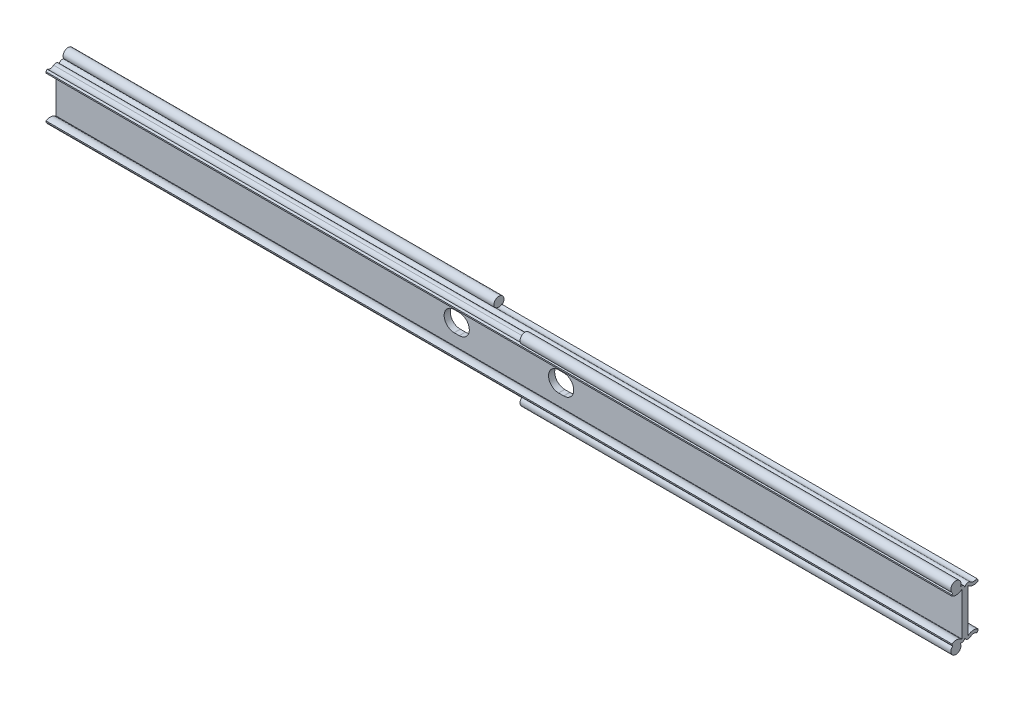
ISO-10303-21;
HEADER;
FILE_DESCRIPTION(('STEP AP214'),'2;1');
FILE_NAME('part.step','',(''),(''),'','','');
FILE_SCHEMA(('AUTOMOTIVE_DESIGN { 1 0 10303 214 1 1 1 1 }'));
ENDSEC;
DATA;
#1=APPLICATION_CONTEXT('core data for automotive mechanical design processes');
#2=APPLICATION_PROTOCOL_DEFINITION('international standard','automotive_design',2000,#1);
#3=PRODUCT_CONTEXT('',#1,'mechanical');
#4=PRODUCT('Part','Part','',(#3));
#5=PRODUCT_RELATED_PRODUCT_CATEGORY('part','',(#4));
#6=PRODUCT_DEFINITION_FORMATION('','',#4);
#7=PRODUCT_DEFINITION_CONTEXT('part definition',#1,'design');
#8=PRODUCT_DEFINITION('design','',#6,#7);
#9=PRODUCT_DEFINITION_SHAPE('','',#8);
#10=(LENGTH_UNIT() NAMED_UNIT(*) SI_UNIT(.MILLI.,.METRE.));
#11=(NAMED_UNIT(*) PLANE_ANGLE_UNIT() SI_UNIT($,.RADIAN.));
#12=(NAMED_UNIT(*) SI_UNIT($,.STERADIAN.) SOLID_ANGLE_UNIT());
#13=UNCERTAINTY_MEASURE_WITH_UNIT(LENGTH_MEASURE(1.E-05),#10,'distance_accuracy_value','');
#14=(GEOMETRIC_REPRESENTATION_CONTEXT(3) GLOBAL_UNCERTAINTY_ASSIGNED_CONTEXT((#13)) GLOBAL_UNIT_ASSIGNED_CONTEXT((#10,
#11,#12)) REPRESENTATION_CONTEXT('',''));
#15=CARTESIAN_POINT('',(0.,0.,0.));
#16=DIRECTION('',(0.,0.,1.));
#17=DIRECTION('',(1.,0.,0.));
#18=AXIS2_PLACEMENT_3D('',#15,#16,#17);
#19=CARTESIAN_POINT('',(-228.6,13.9149993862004,4.44999974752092));
#20=DIRECTION('',(1.,0.,0.));
#21=DIRECTION('',(0.,0.,-1.));
#22=AXIS2_PLACEMENT_3D('',#19,#20,#21);
#23=CYLINDRICAL_SURFACE('',#22,2.54999999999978);
#24=CARTESIAN_POINT('',(11.15,13.9149993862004,4.44999974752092));
#25=DIRECTION('',(1.,0.,0.));
#26=DIRECTION('',(0.,0.,-1.));
#27=AXIS2_PLACEMENT_3D('',#24,#25,#26);
#28=CIRCLE('',#27,2.54999999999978);
#29=CARTESIAN_POINT('',(11.15,12.0059660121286,2.75941062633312));
#30=VERTEX_POINT('',#29);
#31=CARTESIAN_POINT('',(11.15,11.8784793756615,5.98462877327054));
#32=VERTEX_POINT('',#31);
#33=EDGE_CURVE('E323',#30,#32,#28,.F.);
#34=ORIENTED_EDGE('',*,*,#33,.F.);
#35=DIRECTION('',(1.,0.,0.));
#36=VECTOR('',#35,1.);
#37=CARTESIAN_POINT('',(-228.6,12.0059660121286,2.75941062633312));
#38=LINE('',#37,#36);
#39=CARTESIAN_POINT('',(-228.6,12.0059660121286,2.75941062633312));
#40=VERTEX_POINT('',#39);
#41=EDGE_CURVE('E548',#40,#30,#38,.T.);
#42=ORIENTED_EDGE('',*,*,#41,.F.);
#43=CARTESIAN_POINT('',(-228.6,13.9149993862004,4.44999974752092));
#44=DIRECTION('',(1.,0.,0.));
#45=DIRECTION('',(0.,0.,1.));
#46=AXIS2_PLACEMENT_3D('',#43,#44,#45);
#47=CIRCLE('',#46,2.54999999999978);
#48=CARTESIAN_POINT('',(-228.6,11.8784793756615,5.98462877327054));
#49=VERTEX_POINT('',#48);
#50=EDGE_CURVE('E504',#49,#40,#47,.T.);
#51=ORIENTED_EDGE('',*,*,#50,.F.);
#52=DIRECTION('',(1.,0.,0.));
#53=VECTOR('',#52,1.);
#54=CARTESIAN_POINT('',(-228.6,11.8784793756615,5.98462877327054));
#55=LINE('',#54,#53);
#56=EDGE_CURVE('E551',#49,#32,#55,.T.);
#57=ORIENTED_EDGE('',*,*,#56,.T.);
#58=EDGE_LOOP('',(#34,#42,#51,#57));
#59=FACE_BOUND('',#58,.T.);
#60=ADVANCED_FACE('F14',(#59),#23,.F.);
#61=CARTESIAN_POINT('',(-228.6,13.9149993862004,-4.44999974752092));
#62=DIRECTION('',(1.,0.,0.));
#63=DIRECTION('',(0.,0.,-1.));
#64=AXIS2_PLACEMENT_3D('',#61,#62,#63);
#65=CYLINDRICAL_SURFACE('',#64,2.54999999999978);
#66=CARTESIAN_POINT('',(-11.15,13.9149993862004,-4.44999974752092));
#67=DIRECTION('',(-1.,0.,0.));
#68=DIRECTION('',(0.,0.,1.));
#69=AXIS2_PLACEMENT_3D('',#66,#67,#68);
#70=CIRCLE('',#69,2.54999999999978);
#71=CARTESIAN_POINT('',(-11.15,12.0059660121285,-2.75941062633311));
#72=VERTEX_POINT('',#71);
#73=CARTESIAN_POINT('',(-11.15,11.8784793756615,-5.98462877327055));
#74=VERTEX_POINT('',#73);
#75=EDGE_CURVE('E357',#72,#74,#70,.F.);
#76=ORIENTED_EDGE('',*,*,#75,.F.);
#77=DIRECTION('',(1.,0.,0.));
#78=VECTOR('',#77,1.);
#79=CARTESIAN_POINT('',(-228.6,12.0059660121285,-2.75941062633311));
#80=LINE('',#79,#78);
#81=CARTESIAN_POINT('',(228.6,12.0059660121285,-2.75941062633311));
#82=VERTEX_POINT('',#81);
#83=EDGE_CURVE('E543',#72,#82,#80,.T.);
#84=ORIENTED_EDGE('',*,*,#83,.T.);
#85=CARTESIAN_POINT('',(228.6,13.9149993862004,-4.44999974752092));
#86=DIRECTION('',(1.,0.,0.));
#87=DIRECTION('',(0.,0.,-1.));
#88=AXIS2_PLACEMENT_3D('',#85,#86,#87);
#89=CIRCLE('',#88,2.54999999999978);
#90=CARTESIAN_POINT('',(228.6,11.8784793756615,-5.98462877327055));
#91=VERTEX_POINT('',#90);
#92=EDGE_CURVE('E457',#82,#91,#89,.T.);
#93=ORIENTED_EDGE('',*,*,#92,.T.);
#94=DIRECTION('',(1.,0.,0.));
#95=VECTOR('',#94,1.);
#96=CARTESIAN_POINT('',(-228.6,11.8784793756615,-5.98462877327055));
#97=LINE('',#96,#95);
#98=EDGE_CURVE('E541',#74,#91,#97,.T.);
#99=ORIENTED_EDGE('',*,*,#98,.F.);
#100=EDGE_LOOP('',(#76,#84,#93,#99));
#101=FACE_BOUND('',#100,.T.);
#102=ADVANCED_FACE('F682',(#101),#65,.F.);
#103=CARTESIAN_POINT('',(-228.6,-13.9149993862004,-4.44999974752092));
#104=DIRECTION('',(1.,0.,0.));
#105=DIRECTION('',(0.,0.,-1.));
#106=AXIS2_PLACEMENT_3D('',#103,#104,#105);
#107=CYLINDRICAL_SURFACE('',#106,4.09999984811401);
#108=CARTESIAN_POINT('',(228.6,-13.9149993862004,-4.44999974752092));
#109=DIRECTION('',(-1.,0.,0.));
#110=DIRECTION('',(0.,0.,-1.));
#111=AXIS2_PLACEMENT_3D('',#108,#109,#110);
#112=CIRCLE('',#111,4.09999984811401);
#113=CARTESIAN_POINT('',(228.6,-10.8444021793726,-1.73312073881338));
#114=VERTEX_POINT('',#113);
#115=CARTESIAN_POINT('',(228.6,-10.4239395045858,-6.59999966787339));
#116=VERTEX_POINT('',#115);
#117=EDGE_CURVE('E423',#114,#116,#112,.T.);
#118=ORIENTED_EDGE('',*,*,#117,.T.);
#119=DIRECTION('',(1.,0.,0.));
#120=VECTOR('',#119,1.);
#121=CARTESIAN_POINT('',(-228.6,-10.4239395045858,-6.59999966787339));
#122=LINE('',#121,#120);
#123=CARTESIAN_POINT('',(-228.6,-10.4239395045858,-6.59999966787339));
#124=VERTEX_POINT('',#123);
#125=EDGE_CURVE('E591',#124,#116,#122,.T.);
#126=ORIENTED_EDGE('',*,*,#125,.F.);
#127=CARTESIAN_POINT('',(-228.6,-13.9149993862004,-4.44999974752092));
#128=DIRECTION('',(-1.,0.,0.));
#129=DIRECTION('',(0.,0.,-1.));
#130=AXIS2_PLACEMENT_3D('',#127,#128,#129);
#131=CIRCLE('',#130,4.09999984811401);
#132=CARTESIAN_POINT('',(-228.6,-10.8444021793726,-1.73312073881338));
#133=VERTEX_POINT('',#132);
#134=EDGE_CURVE('E472',#133,#124,#131,.T.);
#135=ORIENTED_EDGE('',*,*,#134,.F.);
#136=DIRECTION('',(1.,0.,0.));
#137=VECTOR('',#136,1.);
#138=CARTESIAN_POINT('',(-228.6,-10.8444021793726,-1.73312073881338));
#139=LINE('',#138,#137);
#140=EDGE_CURVE('E523',#133,#114,#139,.T.);
#141=ORIENTED_EDGE('',*,*,#140,.T.);
#142=EDGE_LOOP('',(#118,#126,#135,#141));
#143=FACE_BOUND('',#142,.T.);
#144=ADVANCED_FACE('F16',(#143),#107,.T.);
#145=CARTESIAN_POINT('',(-228.6,-11.0618535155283,-6.59999966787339));
#146=DIRECTION('',(0.,0.,1.));
#147=DIRECTION('',(1.,0.,0.));
#148=AXIS2_PLACEMENT_3D('',#145,#146,#147);
#149=PLANE('',#148);
#150=DIRECTION('',(0.,-1.,0.));
#151=VECTOR('',#150,1.);
#152=CARTESIAN_POINT('',(228.6,-11.0618535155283,-6.59999966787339));
#153=LINE('',#152,#151);
#154=CARTESIAN_POINT('',(228.6,-11.0618535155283,-6.59999966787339));
#155=VERTEX_POINT('',#154);
#156=EDGE_CURVE('E426',#116,#155,#153,.T.);
#157=ORIENTED_EDGE('',*,*,#156,.T.);
#158=DIRECTION('',(1.,0.,0.));
#159=VECTOR('',#158,1.);
#160=CARTESIAN_POINT('',(-228.6,-11.0618535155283,-6.59999966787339));
#161=LINE('',#160,#159);
#162=CARTESIAN_POINT('',(-228.6,-11.0618535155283,-6.59999966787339));
#163=VERTEX_POINT('',#162);
#164=EDGE_CURVE('E588',#163,#155,#161,.T.);
#165=ORIENTED_EDGE('',*,*,#164,.F.);
#166=DIRECTION('',(0.,-1.,0.));
#167=VECTOR('',#166,1.);
#168=CARTESIAN_POINT('',(-228.6,-11.0618535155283,-6.59999966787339));
#169=LINE('',#168,#167);
#170=EDGE_CURVE('E475',#124,#163,#169,.T.);
#171=ORIENTED_EDGE('',*,*,#170,.F.);
#172=ORIENTED_EDGE('',*,*,#125,.T.);
#173=EDGE_LOOP('',(#157,#165,#171,#172));
#174=FACE_BOUND('',#173,.T.);
#175=ADVANCED_FACE('F727',(#174),#149,.F.);
#176=CARTESIAN_POINT('',(-228.6,-11.8784793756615,-5.98462877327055));
#177=DIRECTION('',(0.,0.601814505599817,0.79863590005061));
#178=DIRECTION('',(0.,0.79863590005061,-0.601814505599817));
#179=AXIS2_PLACEMENT_3D('',#176,#177,#178);
#180=PLANE('',#179);
#181=DIRECTION('',(0.,0.79863590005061,-0.601814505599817));
#182=VECTOR('',#181,1.);
#183=CARTESIAN_POINT('',(-11.15,-11.8784793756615,-5.98462877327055));
#184=LINE('',#183,#182);
#185=CARTESIAN_POINT('',(-11.15,-11.8784793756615,-5.98462877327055));
#186=VERTEX_POINT('',#185);
#187=CARTESIAN_POINT('',(-11.15,-11.6159967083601,-6.18242338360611));
#188=VERTEX_POINT('',#187);
#189=EDGE_CURVE('E343',#186,#188,#184,.T.);
#190=ORIENTED_EDGE('',*,*,#189,.T.);
#191=DIRECTION('',(-1.,0.,0.));
#192=VECTOR('',#191,1.);
#193=CARTESIAN_POINT('',(-11.15,-11.6159967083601,-6.18242338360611));
#194=LINE('',#193,#192);
#195=CARTESIAN_POINT('',(-228.6,-11.6159967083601,-6.18242338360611));
#196=VERTEX_POINT('',#195);
#197=EDGE_CURVE('E337',#188,#196,#194,.T.);
#198=ORIENTED_EDGE('',*,*,#197,.T.);
#199=DIRECTION('',(0.,-0.79863590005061,0.601814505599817));
#200=VECTOR('',#199,1.);
#201=CARTESIAN_POINT('',(-228.6,-11.8784793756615,-5.98462877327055));
#202=LINE('',#201,#200);
#203=EDGE_CURVE('E477',#163,#196,#202,.T.);
#204=ORIENTED_EDGE('',*,*,#203,.F.);
#205=ORIENTED_EDGE('',*,*,#164,.T.);
#206=DIRECTION('',(0.,-0.79863590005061,0.601814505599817));
#207=VECTOR('',#206,1.);
#208=CARTESIAN_POINT('',(228.6,-11.8784793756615,-5.98462877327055));
#209=LINE('',#208,#207);
#210=CARTESIAN_POINT('',(228.6,-11.8784793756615,-5.98462877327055));
#211=VERTEX_POINT('',#210);
#212=EDGE_CURVE('E428',#155,#211,#209,.T.);
#213=ORIENTED_EDGE('',*,*,#212,.T.);
#214=DIRECTION('',(1.,0.,0.));
#215=VECTOR('',#214,1.);
#216=CARTESIAN_POINT('',(-228.6,-11.8784793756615,-5.98462877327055));
#217=LINE('',#216,#215);
#218=EDGE_CURVE('E586',#186,#211,#217,.T.);
#219=ORIENTED_EDGE('',*,*,#218,.F.);
#220=EDGE_LOOP('',(#190,#198,#204,#205,#213,#219));
#221=FACE_BOUND('',#220,.T.);
#222=ADVANCED_FACE('F724',(#221),#180,.F.);
#223=CARTESIAN_POINT('',(-228.6,-13.9149993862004,-4.44999974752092));
#224=DIRECTION('',(1.,0.,0.));
#225=DIRECTION('',(0.,0.,-1.));
#226=AXIS2_PLACEMENT_3D('',#223,#224,#225);
#227=CYLINDRICAL_SURFACE('',#226,2.54999999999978);
#228=DIRECTION('',(1.,0.,0.));
#229=VECTOR('',#228,1.);
#230=CARTESIAN_POINT('',(-228.6,-12.0059660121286,-2.75941062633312));
#231=LINE('',#230,#229);
#232=CARTESIAN_POINT('',(-11.15,-12.0059660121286,-2.75941062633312));
#233=VERTEX_POINT('',#232);
#234=CARTESIAN_POINT('',(228.6,-12.0059660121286,-2.75941062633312));
#235=VERTEX_POINT('',#234);
#236=EDGE_CURVE('E584',#233,#235,#231,.T.);
#237=ORIENTED_EDGE('',*,*,#236,.F.);
#238=CARTESIAN_POINT('',(-11.15,-13.9149993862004,-4.44999974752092));
#239=DIRECTION('',(1.,0.,0.));
#240=DIRECTION('',(0.,0.,-1.));
#241=AXIS2_PLACEMENT_3D('',#238,#239,#240);
#242=CIRCLE('',#241,2.54999999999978);
#243=EDGE_CURVE('E340',#233,#186,#242,.F.);
#244=ORIENTED_EDGE('',*,*,#243,.T.);
#245=ORIENTED_EDGE('',*,*,#218,.T.);
#246=CARTESIAN_POINT('',(228.6,-13.9149993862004,-4.44999974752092));
#247=DIRECTION('',(1.,0.,0.));
#248=DIRECTION('',(0.,0.,1.));
#249=AXIS2_PLACEMENT_3D('',#246,#247,#248);
#250=CIRCLE('',#249,2.54999999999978);
#251=EDGE_CURVE('E431',#211,#235,#250,.T.);
#252=ORIENTED_EDGE('',*,*,#251,.T.);
#253=EDGE_LOOP('',(#237,#244,#245,#252));
#254=FACE_BOUND('',#253,.T.);
#255=ADVANCED_FACE('F720',(#254),#227,.F.);
#256=CARTESIAN_POINT('',(-228.6,-10.7622235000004,-1.65999984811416));
#257=DIRECTION('',(1.,0.,0.));
#258=DIRECTION('',(0.,0.,-1.));
#259=AXIS2_PLACEMENT_3D('',#256,#257,#258);
#260=CYLINDRICAL_SURFACE('',#259,1.65999984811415);
#261=CARTESIAN_POINT('',(-228.6,-10.7622235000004,-1.65999984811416));
#262=DIRECTION('',(-1.,0.,0.));
#263=DIRECTION('',(0.,0.,-1.));
#264=AXIS2_PLACEMENT_3D('',#261,#262,#263);
#265=CIRCLE('',#264,1.65999984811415);
#266=CARTESIAN_POINT('',(-228.6,-12.2669165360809,-2.36106929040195));
#267=VERTEX_POINT('',#266);
#268=CARTESIAN_POINT('',(-228.6,-10.7622235,0.));
#269=VERTEX_POINT('',#268);
#270=EDGE_CURVE('E480',#267,#269,#265,.T.);
#271=ORIENTED_EDGE('',*,*,#270,.F.);
#272=DIRECTION('',(-1.,0.,0.));
#273=VECTOR('',#272,1.);
#274=CARTESIAN_POINT('',(-119.875,-12.2669165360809,-2.36106929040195));
#275=LINE('',#274,#273);
#276=CARTESIAN_POINT('',(-11.15,-12.2669165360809,-2.36106929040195));
#277=VERTEX_POINT('',#276);
#278=EDGE_CURVE('E333',#267,#277,#275,.F.);
#279=ORIENTED_EDGE('',*,*,#278,.T.);
#280=CARTESIAN_POINT('',(-11.15,-10.7622235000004,-1.65999984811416));
#281=DIRECTION('',(1.,0.,0.));
#282=DIRECTION('',(0.,0.,-1.));
#283=AXIS2_PLACEMENT_3D('',#280,#281,#282);
#284=CIRCLE('',#283,1.65999984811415);
#285=EDGE_CURVE('E596',#277,#233,#284,.T.);
#286=ORIENTED_EDGE('',*,*,#285,.T.);
#287=ORIENTED_EDGE('',*,*,#236,.T.);
#288=CARTESIAN_POINT('',(228.6,-10.7622235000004,-1.65999984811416));
#289=DIRECTION('',(-1.,0.,0.));
#290=DIRECTION('',(0.,0.,-1.));
#291=AXIS2_PLACEMENT_3D('',#288,#289,#290);
#292=CIRCLE('',#291,1.65999984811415);
#293=CARTESIAN_POINT('',(228.6,-10.7622235,0.));
#294=VERTEX_POINT('',#293);
#295=EDGE_CURVE('E434',#235,#294,#292,.T.);
#296=ORIENTED_EDGE('',*,*,#295,.T.);
#297=DIRECTION('',(1.,0.,0.));
#298=VECTOR('',#297,1.);
#299=CARTESIAN_POINT('',(-228.6,-10.7622235,0.));
#300=LINE('',#299,#298);
#301=EDGE_CURVE('E581',#269,#294,#300,.T.);
#302=ORIENTED_EDGE('',*,*,#301,.F.);
#303=EDGE_LOOP('',(#271,#279,#286,#287,#296,#302));
#304=FACE_BOUND('',#303,.T.);
#305=ADVANCED_FACE('F717',(#304),#260,.T.);
#306=CARTESIAN_POINT('',(-228.6,-10.7622235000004,1.65999984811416));
#307=DIRECTION('',(1.,0.,0.));
#308=DIRECTION('',(0.,0.,-1.));
#309=AXIS2_PLACEMENT_3D('',#306,#307,#308);
#310=CYLINDRICAL_SURFACE('',#309,1.65999984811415);
#311=CARTESIAN_POINT('',(228.6,-10.7622235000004,1.65999984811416));
#312=DIRECTION('',(-1.,0.,0.));
#313=DIRECTION('',(0.,0.,1.));
#314=AXIS2_PLACEMENT_3D('',#311,#312,#313);
#315=CIRCLE('',#314,1.65999984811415);
#316=CARTESIAN_POINT('',(228.6,-12.2669165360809,2.36106929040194));
#317=VERTEX_POINT('',#316);
#318=EDGE_CURVE('E292',#294,#317,#315,.T.);
#319=ORIENTED_EDGE('',*,*,#318,.T.);
#320=DIRECTION('',(1.,0.,0.));
#321=VECTOR('',#320,1.);
#322=CARTESIAN_POINT('',(119.875,-12.2669165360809,2.36106929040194));
#323=LINE('',#322,#321);
#324=CARTESIAN_POINT('',(11.15,-12.2669165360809,2.36106929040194));
#325=VERTEX_POINT('',#324);
#326=EDGE_CURVE('E29',#317,#325,#323,.F.);
#327=ORIENTED_EDGE('',*,*,#326,.T.);
#328=CARTESIAN_POINT('',(11.15,-10.7622235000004,1.65999984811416));
#329=DIRECTION('',(-1.,0.,0.));
#330=DIRECTION('',(0.,0.,1.));
#331=AXIS2_PLACEMENT_3D('',#328,#329,#330);
#332=CIRCLE('',#331,1.65999984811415);
#333=CARTESIAN_POINT('',(11.15,-12.0059660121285,2.75941062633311));
#334=VERTEX_POINT('',#333);
#335=EDGE_CURVE('E33',#325,#334,#332,.T.);
#336=ORIENTED_EDGE('',*,*,#335,.T.);
#337=DIRECTION('',(1.,0.,0.));
#338=VECTOR('',#337,1.);
#339=CARTESIAN_POINT('',(-228.6,-12.0059660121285,2.75941062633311));
#340=LINE('',#339,#338);
#341=CARTESIAN_POINT('',(-228.6,-12.0059660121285,2.75941062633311));
#342=VERTEX_POINT('',#341);
#343=EDGE_CURVE('E579',#342,#334,#340,.T.);
#344=ORIENTED_EDGE('',*,*,#343,.F.);
#345=CARTESIAN_POINT('',(-228.6,-10.7622235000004,1.65999984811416));
#346=DIRECTION('',(-1.,0.,0.));
#347=DIRECTION('',(0.,0.,1.));
#348=AXIS2_PLACEMENT_3D('',#345,#346,#347);
#349=CIRCLE('',#348,1.65999984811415);
#350=EDGE_CURVE('E482',#269,#342,#349,.T.);
#351=ORIENTED_EDGE('',*,*,#350,.F.);
#352=ORIENTED_EDGE('',*,*,#301,.T.);
#353=EDGE_LOOP('',(#319,#327,#336,#344,#351,#352));
#354=FACE_BOUND('',#353,.T.);
#355=ADVANCED_FACE('F714',(#354),#310,.T.);
#356=CARTESIAN_POINT('',(-228.6,-13.9149993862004,4.44999974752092));
#357=DIRECTION('',(1.,0.,0.));
#358=DIRECTION('',(0.,0.,-1.));
#359=AXIS2_PLACEMENT_3D('',#356,#357,#358);
#360=CYLINDRICAL_SURFACE('',#359,2.54999999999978);
#361=ORIENTED_EDGE('',*,*,#343,.T.);
#362=CARTESIAN_POINT('',(11.15,-13.9149993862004,4.44999974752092));
#363=DIRECTION('',(-1.,0.,0.));
#364=DIRECTION('',(0.,0.,1.));
#365=AXIS2_PLACEMENT_3D('',#362,#363,#364);
#366=CIRCLE('',#365,2.54999999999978);
#367=CARTESIAN_POINT('',(11.15,-11.8784793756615,5.98462877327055));
#368=VERTEX_POINT('',#367);
#369=EDGE_CURVE('E309',#334,#368,#366,.F.);
#370=ORIENTED_EDGE('',*,*,#369,.T.);
#371=DIRECTION('',(1.,0.,0.));
#372=VECTOR('',#371,1.);
#373=CARTESIAN_POINT('',(-228.6,-11.8784793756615,5.98462877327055));
#374=LINE('',#373,#372);
#375=CARTESIAN_POINT('',(-228.6,-11.8784793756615,5.98462877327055));
#376=VERTEX_POINT('',#375);
#377=EDGE_CURVE('E577',#376,#368,#374,.T.);
#378=ORIENTED_EDGE('',*,*,#377,.F.);
#379=CARTESIAN_POINT('',(-228.6,-13.9149993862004,4.44999974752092));
#380=DIRECTION('',(1.,0.,0.));
#381=DIRECTION('',(0.,0.,-1.));
#382=AXIS2_PLACEMENT_3D('',#379,#380,#381);
#383=CIRCLE('',#382,2.54999999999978);
#384=EDGE_CURVE('E484',#342,#376,#383,.T.);
#385=ORIENTED_EDGE('',*,*,#384,.F.);
#386=EDGE_LOOP('',(#361,#370,#378,#385));
#387=FACE_BOUND('',#386,.T.);
#388=ADVANCED_FACE('F667',(#387),#360,.F.);
#389=CARTESIAN_POINT('',(-228.6,-11.8784793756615,5.98462877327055));
#390=DIRECTION('',(0.,0.601814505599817,-0.79863590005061));
#391=DIRECTION('',(0.,-0.79863590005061,-0.601814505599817));
#392=AXIS2_PLACEMENT_3D('',#389,#390,#391);
#393=PLANE('',#392);
#394=DIRECTION('',(0.,0.79863590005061,0.601814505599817));
#395=VECTOR('',#394,1.);
#396=CARTESIAN_POINT('',(11.15,-11.8784793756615,5.98462877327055));
#397=LINE('',#396,#395);
#398=CARTESIAN_POINT('',(11.15,-11.6159967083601,6.18242338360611));
#399=VERTEX_POINT('',#398);
#400=EDGE_CURVE('E9',#368,#399,#397,.T.);
#401=ORIENTED_EDGE('',*,*,#400,.T.);
#402=DIRECTION('',(1.,0.,0.));
#403=VECTOR('',#402,1.);
#404=CARTESIAN_POINT('',(11.15,-11.6159967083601,6.18242338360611));
#405=LINE('',#404,#403);
#406=CARTESIAN_POINT('',(228.6,-11.6159967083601,6.18242338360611));
#407=VERTEX_POINT('',#406);
#408=EDGE_CURVE('E295',#399,#407,#405,.T.);
#409=ORIENTED_EDGE('',*,*,#408,.T.);
#410=DIRECTION('',(0.,0.79863590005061,0.601814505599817));
#411=VECTOR('',#410,1.);
#412=CARTESIAN_POINT('',(228.6,-11.8784793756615,5.98462877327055));
#413=LINE('',#412,#411);
#414=CARTESIAN_POINT('',(228.6,-11.0618535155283,6.59999966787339));
#415=VERTEX_POINT('',#414);
#416=EDGE_CURVE('E281',#407,#415,#413,.T.);
#417=ORIENTED_EDGE('',*,*,#416,.T.);
#418=DIRECTION('',(1.,0.,0.));
#419=VECTOR('',#418,1.);
#420=CARTESIAN_POINT('',(-228.6,-11.0618535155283,6.59999966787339));
#421=LINE('',#420,#419);
#422=CARTESIAN_POINT('',(-228.6,-11.0618535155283,6.59999966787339));
#423=VERTEX_POINT('',#422);
#424=EDGE_CURVE('E575',#423,#415,#421,.T.);
#425=ORIENTED_EDGE('',*,*,#424,.F.);
#426=DIRECTION('',(0.,0.79863590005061,0.601814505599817));
#427=VECTOR('',#426,1.);
#428=CARTESIAN_POINT('',(-228.6,-11.8784793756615,5.98462877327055));
#429=LINE('',#428,#427);
#430=EDGE_CURVE('E486',#376,#423,#429,.T.);
#431=ORIENTED_EDGE('',*,*,#430,.F.);
#432=ORIENTED_EDGE('',*,*,#377,.T.);
#433=EDGE_LOOP('',(#401,#409,#417,#425,#431,#432));
#434=FACE_BOUND('',#433,.T.);
#435=ADVANCED_FACE('F296',(#434),#393,.F.);
#436=CARTESIAN_POINT('',(-228.6,-11.0618535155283,6.59999966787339));
#437=DIRECTION('',(0.,0.,-1.));
#438=DIRECTION('',(-1.,0.,0.));
#439=AXIS2_PLACEMENT_3D('',#436,#437,#438);
#440=PLANE('',#439);
#441=DIRECTION('',(0.,1.,0.));
#442=VECTOR('',#441,1.);
#443=CARTESIAN_POINT('',(228.6,-11.0618535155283,6.59999966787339));
#444=LINE('',#443,#442);
#445=CARTESIAN_POINT('',(228.6,-10.4239395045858,6.59999966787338));
#446=VERTEX_POINT('',#445);
#447=EDGE_CURVE('E288',#415,#446,#444,.T.);
#448=ORIENTED_EDGE('',*,*,#447,.T.);
#449=DIRECTION('',(1.,0.,0.));
#450=VECTOR('',#449,1.);
#451=CARTESIAN_POINT('',(-228.6,-10.4239395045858,6.59999966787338));
#452=LINE('',#451,#450);
#453=CARTESIAN_POINT('',(-228.6,-10.4239395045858,6.59999966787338));
#454=VERTEX_POINT('',#453);
#455=EDGE_CURVE('E572',#454,#446,#452,.T.);
#456=ORIENTED_EDGE('',*,*,#455,.F.);
#457=DIRECTION('',(0.,1.,0.));
#458=VECTOR('',#457,1.);
#459=CARTESIAN_POINT('',(-228.6,-11.0618535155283,6.59999966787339));
#460=LINE('',#459,#458);
#461=EDGE_CURVE('E488',#423,#454,#460,.T.);
#462=ORIENTED_EDGE('',*,*,#461,.F.);
#463=ORIENTED_EDGE('',*,*,#424,.T.);
#464=EDGE_LOOP('',(#448,#456,#462,#463));
#465=FACE_BOUND('',#464,.T.);
#466=ADVANCED_FACE('F661',(#465),#440,.F.);
#467=CARTESIAN_POINT('',(-228.6,-13.9149993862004,4.44999974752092));
#468=DIRECTION('',(1.,0.,0.));
#469=DIRECTION('',(0.,0.,-1.));
#470=AXIS2_PLACEMENT_3D('',#467,#468,#469);
#471=CYLINDRICAL_SURFACE('',#470,4.09999984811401);
#472=CARTESIAN_POINT('',(228.6,-13.9149993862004,4.44999974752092));
#473=DIRECTION('',(-1.,0.,0.));
#474=DIRECTION('',(0.,0.,1.));
#475=AXIS2_PLACEMENT_3D('',#472,#473,#474);
#476=CIRCLE('',#475,4.09999984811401);
#477=CARTESIAN_POINT('',(228.6,-10.8444021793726,1.73312073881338));
#478=VERTEX_POINT('',#477);
#479=EDGE_CURVE('E438',#446,#478,#476,.T.);
#480=ORIENTED_EDGE('',*,*,#479,.T.);
#481=DIRECTION('',(1.,0.,0.));
#482=VECTOR('',#481,1.);
#483=CARTESIAN_POINT('',(-228.6,-10.8444021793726,1.73312073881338));
#484=LINE('',#483,#482);
#485=CARTESIAN_POINT('',(-228.6,-10.8444021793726,1.73312073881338));
#486=VERTEX_POINT('',#485);
#487=EDGE_CURVE('E569',#486,#478,#484,.T.);
#488=ORIENTED_EDGE('',*,*,#487,.F.);
#489=CARTESIAN_POINT('',(-228.6,-13.9149993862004,4.44999974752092));
#490=DIRECTION('',(-1.,0.,0.));
#491=DIRECTION('',(0.,0.,1.));
#492=AXIS2_PLACEMENT_3D('',#489,#490,#491);
#493=CIRCLE('',#492,4.09999984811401);
#494=EDGE_CURVE('E490',#454,#486,#493,.T.);
#495=ORIENTED_EDGE('',*,*,#494,.F.);
#496=ORIENTED_EDGE('',*,*,#455,.T.);
#497=EDGE_LOOP('',(#480,#488,#495,#496));
#498=FACE_BOUND('',#497,.T.);
#499=ADVANCED_FACE('F657',(#498),#471,.T.);
#500=CARTESIAN_POINT('',(-228.6,-10.7622235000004,1.65999984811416));
#501=DIRECTION('',(1.,0.,0.));
#502=DIRECTION('',(0.,0.,-1.));
#503=AXIS2_PLACEMENT_3D('',#500,#501,#502);
#504=CYLINDRICAL_SURFACE('',#503,0.110000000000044);
#505=CARTESIAN_POINT('',(228.6,-10.7622235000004,1.65999984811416));
#506=DIRECTION('',(1.,0.,0.));
#507=DIRECTION('',(0.,0.,-1.));
#508=AXIS2_PLACEMENT_3D('',#505,#506,#507);
#509=CIRCLE('',#508,0.110000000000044);
#510=CARTESIAN_POINT('',(228.6,-10.7622235,1.5499998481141));
#511=VERTEX_POINT('',#510);
#512=EDGE_CURVE('E440',#478,#511,#509,.T.);
#513=ORIENTED_EDGE('',*,*,#512,.T.);
#514=DIRECTION('',(1.,0.,0.));
#515=VECTOR('',#514,1.);
#516=CARTESIAN_POINT('',(-228.6,-10.7622235,1.5499998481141));
#517=LINE('',#516,#515);
#518=CARTESIAN_POINT('',(-228.6,-10.7622235,1.5499998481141));
#519=VERTEX_POINT('',#518);
#520=EDGE_CURVE('E566',#519,#511,#517,.T.);
#521=ORIENTED_EDGE('',*,*,#520,.F.);
#522=CARTESIAN_POINT('',(-228.6,-10.7622235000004,1.65999984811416));
#523=DIRECTION('',(1.,0.,0.));
#524=DIRECTION('',(0.,0.,-1.));
#525=AXIS2_PLACEMENT_3D('',#522,#523,#524);
#526=CIRCLE('',#525,0.110000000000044);
#527=EDGE_CURVE('E492',#486,#519,#526,.T.);
#528=ORIENTED_EDGE('',*,*,#527,.F.);
#529=ORIENTED_EDGE('',*,*,#487,.T.);
#530=EDGE_LOOP('',(#513,#521,#528,#529));
#531=FACE_BOUND('',#530,.T.);
#532=ADVANCED_FACE('F652',(#531),#504,.F.);
#533=CARTESIAN_POINT('',(-228.6,10.7622235,1.5499998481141));
#534=DIRECTION('',(0.,0.,-1.));
#535=DIRECTION('',(-1.,0.,0.));
#536=AXIS2_PLACEMENT_3D('',#533,#534,#535);
#537=PLANE('',#536);
#538=DIRECTION('',(1.,0.,0.));
#539=VECTOR('',#538,1.);
#540=CARTESIAN_POINT('',(27.65,-5.05,1.5499998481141));
#541=LINE('',#540,#539);
#542=CARTESIAN_POINT('',(25.05,-5.05,1.5499998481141));
#543=VERTEX_POINT('',#542);
#544=CARTESIAN_POINT('',(27.65,-5.05,1.5499998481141));
#545=VERTEX_POINT('',#544);
#546=EDGE_CURVE('E371',#543,#545,#541,.T.);
#547=ORIENTED_EDGE('',*,*,#546,.F.);
#548=CARTESIAN_POINT('',(25.05,0.,1.5499998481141));
#549=DIRECTION('',(0.,0.,1.));
#550=DIRECTION('',(1.,0.,0.));
#551=AXIS2_PLACEMENT_3D('',#548,#549,#550);
#552=CIRCLE('',#551,5.05);
#553=CARTESIAN_POINT('',(25.05,5.05,1.5499998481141));
#554=VERTEX_POINT('',#553);
#555=EDGE_CURVE('E369',#554,#543,#552,.T.);
#556=ORIENTED_EDGE('',*,*,#555,.F.);
#557=DIRECTION('',(-1.,0.,0.));
#558=VECTOR('',#557,1.);
#559=CARTESIAN_POINT('',(25.05,5.05,1.5499998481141));
#560=LINE('',#559,#558);
#561=CARTESIAN_POINT('',(27.65,5.05,1.5499998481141));
#562=VERTEX_POINT('',#561);
#563=EDGE_CURVE('E377',#562,#554,#560,.T.);
#564=ORIENTED_EDGE('',*,*,#563,.F.);
#565=CARTESIAN_POINT('',(27.65,0.,1.5499998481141));
#566=DIRECTION('',(0.,0.,1.));
#567=DIRECTION('',(1.,0.,0.));
#568=AXIS2_PLACEMENT_3D('',#565,#566,#567);
#569=CIRCLE('',#568,5.05);
#570=EDGE_CURVE('E374',#545,#562,#569,.T.);
#571=ORIENTED_EDGE('',*,*,#570,.F.);
#572=EDGE_LOOP('',(#547,#556,#564,#571));
#573=FACE_BOUND('',#572,.T.);
#574=DIRECTION('',(1.,0.,0.));
#575=VECTOR('',#574,1.);
#576=CARTESIAN_POINT('',(-27.65,-5.05,1.5499998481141));
#577=LINE('',#576,#575);
#578=CARTESIAN_POINT('',(-27.65,-5.05,1.5499998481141));
#579=VERTEX_POINT('',#578);
#580=CARTESIAN_POINT('',(-25.05,-5.05,1.5499998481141));
#581=VERTEX_POINT('',#580);
#582=EDGE_CURVE('E402',#579,#581,#577,.T.);
#583=ORIENTED_EDGE('',*,*,#582,.F.);
#584=CARTESIAN_POINT('',(-27.65,0.,1.5499998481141));
#585=DIRECTION('',(0.,0.,1.));
#586=DIRECTION('',(-1.,0.,0.));
#587=AXIS2_PLACEMENT_3D('',#584,#585,#586);
#588=CIRCLE('',#587,5.05);
#589=CARTESIAN_POINT('',(-27.65,5.05,1.5499998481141));
#590=VERTEX_POINT('',#589);
#591=EDGE_CURVE('E400',#590,#579,#588,.T.);
#592=ORIENTED_EDGE('',*,*,#591,.F.);
#593=DIRECTION('',(-1.,0.,0.));
#594=VECTOR('',#593,1.);
#595=CARTESIAN_POINT('',(-25.05,5.05,1.5499998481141));
#596=LINE('',#595,#594);
#597=CARTESIAN_POINT('',(-25.05,5.05,1.5499998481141));
#598=VERTEX_POINT('',#597);
#599=EDGE_CURVE('E408',#598,#590,#596,.T.);
#600=ORIENTED_EDGE('',*,*,#599,.F.);
#601=CARTESIAN_POINT('',(-25.05,0.,1.5499998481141));
#602=DIRECTION('',(0.,0.,1.));
#603=DIRECTION('',(-1.,0.,0.));
#604=AXIS2_PLACEMENT_3D('',#601,#602,#603);
#605=CIRCLE('',#604,5.05);
#606=EDGE_CURVE('E405',#581,#598,#605,.T.);
#607=ORIENTED_EDGE('',*,*,#606,.F.);
#608=EDGE_LOOP('',(#583,#592,#600,#607));
#609=FACE_BOUND('',#608,.T.);
#610=DIRECTION('',(0.,1.,0.));
#611=VECTOR('',#610,1.);
#612=CARTESIAN_POINT('',(228.6,10.7622235,1.5499998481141));
#613=LINE('',#612,#611);
#614=CARTESIAN_POINT('',(228.6,10.7622235,1.54999984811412));
#615=VERTEX_POINT('',#614);
#616=EDGE_CURVE('E442',#511,#615,#613,.T.);
#617=ORIENTED_EDGE('',*,*,#616,.T.);
#618=DIRECTION('',(1.,0.,0.));
#619=VECTOR('',#618,1.);
#620=CARTESIAN_POINT('',(-228.6,10.7622235,1.54999984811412));
#621=LINE('',#620,#619);
#622=CARTESIAN_POINT('',(-228.6,10.7622235,1.54999984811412));
#623=VERTEX_POINT('',#622);
#624=EDGE_CURVE('E563',#623,#615,#621,.T.);
#625=ORIENTED_EDGE('',*,*,#624,.F.);
#626=DIRECTION('',(0.,1.,0.));
#627=VECTOR('',#626,1.);
#628=CARTESIAN_POINT('',(-228.6,10.7622235,1.5499998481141));
#629=LINE('',#628,#627);
#630=EDGE_CURVE('E494',#519,#623,#629,.T.);
#631=ORIENTED_EDGE('',*,*,#630,.F.);
#632=ORIENTED_EDGE('',*,*,#520,.T.);
#633=EDGE_LOOP('',(#617,#625,#631,#632));
#634=FACE_BOUND('',#633,.T.);
#635=ADVANCED_FACE('F648',(#573,#609,#634),#537,.F.);
#636=CARTESIAN_POINT('',(-228.6,10.7622235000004,1.65999984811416));
#637=DIRECTION('',(1.,0.,0.));
#638=DIRECTION('',(0.,0.,-1.));
#639=AXIS2_PLACEMENT_3D('',#636,#637,#638);
#640=CYLINDRICAL_SURFACE('',#639,0.110000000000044);
#641=CARTESIAN_POINT('',(228.6,10.7622235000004,1.65999984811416));
#642=DIRECTION('',(1.,0.,0.));
#643=DIRECTION('',(0.,0.,1.));
#644=AXIS2_PLACEMENT_3D('',#641,#642,#643);
#645=CIRCLE('',#644,0.110000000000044);
#646=CARTESIAN_POINT('',(228.6,10.8444021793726,1.73312073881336));
#647=VERTEX_POINT('',#646);
#648=EDGE_CURVE('E444',#615,#647,#645,.T.);
#649=ORIENTED_EDGE('',*,*,#648,.T.);
#650=DIRECTION('',(1.,0.,0.));
#651=VECTOR('',#650,1.);
#652=CARTESIAN_POINT('',(-228.6,10.8444021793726,1.73312073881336));
#653=LINE('',#652,#651);
#654=CARTESIAN_POINT('',(-228.6,10.8444021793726,1.73312073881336));
#655=VERTEX_POINT('',#654);
#656=EDGE_CURVE('E560',#655,#647,#653,.T.);
#657=ORIENTED_EDGE('',*,*,#656,.F.);
#658=CARTESIAN_POINT('',(-228.6,10.7622235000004,1.65999984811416));
#659=DIRECTION('',(1.,0.,0.));
#660=DIRECTION('',(0.,0.,1.));
#661=AXIS2_PLACEMENT_3D('',#658,#659,#660);
#662=CIRCLE('',#661,0.110000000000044);
#663=EDGE_CURVE('E496',#623,#655,#662,.T.);
#664=ORIENTED_EDGE('',*,*,#663,.F.);
#665=ORIENTED_EDGE('',*,*,#624,.T.);
#666=EDGE_LOOP('',(#649,#657,#664,#665));
#667=FACE_BOUND('',#666,.T.);
#668=ADVANCED_FACE('F644',(#667),#640,.F.);
#669=CARTESIAN_POINT('',(-228.6,13.9149993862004,4.44999974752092));
#670=DIRECTION('',(1.,0.,0.));
#671=DIRECTION('',(0.,0.,-1.));
#672=AXIS2_PLACEMENT_3D('',#669,#670,#671);
#673=CYLINDRICAL_SURFACE('',#672,4.09999984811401);
#674=CARTESIAN_POINT('',(228.6,13.9149993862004,4.44999974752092));
#675=DIRECTION('',(-1.,0.,0.));
#676=DIRECTION('',(0.,0.,-1.));
#677=AXIS2_PLACEMENT_3D('',#674,#675,#676);
#678=CIRCLE('',#677,4.09999984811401);
#679=CARTESIAN_POINT('',(228.6,10.4239395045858,6.59999966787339));
#680=VERTEX_POINT('',#679);
#681=EDGE_CURVE('E446',#647,#680,#678,.T.);
#682=ORIENTED_EDGE('',*,*,#681,.T.);
#683=DIRECTION('',(1.,0.,0.));
#684=VECTOR('',#683,1.);
#685=CARTESIAN_POINT('',(-228.6,10.4239395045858,6.59999966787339));
#686=LINE('',#685,#684);
#687=CARTESIAN_POINT('',(-228.6,10.4239395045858,6.59999966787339));
#688=VERTEX_POINT('',#687);
#689=EDGE_CURVE('E557',#688,#680,#686,.T.);
#690=ORIENTED_EDGE('',*,*,#689,.F.);
#691=CARTESIAN_POINT('',(-228.6,13.9149993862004,4.44999974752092));
#692=DIRECTION('',(-1.,0.,0.));
#693=DIRECTION('',(0.,0.,-1.));
#694=AXIS2_PLACEMENT_3D('',#691,#692,#693);
#695=CIRCLE('',#694,4.09999984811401);
#696=EDGE_CURVE('E498',#655,#688,#695,.T.);
#697=ORIENTED_EDGE('',*,*,#696,.F.);
#698=ORIENTED_EDGE('',*,*,#656,.T.);
#699=EDGE_LOOP('',(#682,#690,#697,#698));
#700=FACE_BOUND('',#699,.T.);
#701=ADVANCED_FACE('F639',(#700),#673,.T.);
#702=CARTESIAN_POINT('',(-228.6,11.0618535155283,6.59999966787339));
#703=DIRECTION('',(0.,0.,-1.));
#704=DIRECTION('',(-1.,0.,0.));
#705=AXIS2_PLACEMENT_3D('',#702,#703,#704);
#706=PLANE('',#705);
#707=DIRECTION('',(0.,1.,0.));
#708=VECTOR('',#707,1.);
#709=CARTESIAN_POINT('',(228.6,11.0618535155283,6.59999966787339));
#710=LINE('',#709,#708);
#711=CARTESIAN_POINT('',(228.6,11.0618535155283,6.59999966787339));
#712=VERTEX_POINT('',#711);
#713=EDGE_CURVE('E448',#680,#712,#710,.T.);
#714=ORIENTED_EDGE('',*,*,#713,.T.);
#715=DIRECTION('',(1.,0.,0.));
#716=VECTOR('',#715,1.);
#717=CARTESIAN_POINT('',(-228.6,11.0618535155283,6.59999966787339));
#718=LINE('',#717,#716);
#719=CARTESIAN_POINT('',(-228.6,11.0618535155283,6.59999966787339));
#720=VERTEX_POINT('',#719);
#721=EDGE_CURVE('E554',#720,#712,#718,.T.);
#722=ORIENTED_EDGE('',*,*,#721,.F.);
#723=DIRECTION('',(0.,1.,0.));
#724=VECTOR('',#723,1.);
#725=CARTESIAN_POINT('',(-228.6,11.0618535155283,6.59999966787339));
#726=LINE('',#725,#724);
#727=EDGE_CURVE('E500',#688,#720,#726,.T.);
#728=ORIENTED_EDGE('',*,*,#727,.F.);
#729=ORIENTED_EDGE('',*,*,#689,.T.);
#730=EDGE_LOOP('',(#714,#722,#728,#729));
#731=FACE_BOUND('',#730,.T.);
#732=ADVANCED_FACE('F633',(#731),#706,.F.);
#733=CARTESIAN_POINT('',(-228.6,11.8784793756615,5.98462877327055));
#734=DIRECTION('',(0.,-0.601814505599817,-0.79863590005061));
#735=DIRECTION('',(0.,-0.79863590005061,0.601814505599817));
#736=AXIS2_PLACEMENT_3D('',#733,#734,#735);
#737=PLANE('',#736);
#738=DIRECTION('',(0.,0.79863590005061,-0.601814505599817));
#739=VECTOR('',#738,1.);
#740=CARTESIAN_POINT('',(228.6,11.8784793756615,5.98462877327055));
#741=LINE('',#740,#739);
#742=CARTESIAN_POINT('',(228.6,11.6159967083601,6.18242338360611));
#743=VERTEX_POINT('',#742);
#744=EDGE_CURVE('E450',#712,#743,#741,.T.);
#745=ORIENTED_EDGE('',*,*,#744,.T.);
#746=DIRECTION('',(1.,0.,0.));
#747=VECTOR('',#746,1.);
#748=CARTESIAN_POINT('',(11.15,11.6159967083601,6.18242338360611));
#749=LINE('',#748,#747);
#750=CARTESIAN_POINT('',(11.15,11.6159967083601,6.18242338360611));
#751=VERTEX_POINT('',#750);
#752=EDGE_CURVE('E321',#743,#751,#749,.F.);
#753=ORIENTED_EDGE('',*,*,#752,.T.);
#754=DIRECTION('',(0.,-0.79863590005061,0.601814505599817));
#755=VECTOR('',#754,1.);
#756=CARTESIAN_POINT('',(11.15,11.8784793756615,5.98462877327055));
#757=LINE('',#756,#755);
#758=EDGE_CURVE('E326',#32,#751,#757,.T.);
#759=ORIENTED_EDGE('',*,*,#758,.F.);
#760=ORIENTED_EDGE('',*,*,#56,.F.);
#761=DIRECTION('',(0.,0.79863590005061,-0.601814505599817));
#762=VECTOR('',#761,1.);
#763=CARTESIAN_POINT('',(-228.6,11.8784793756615,5.98462877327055));
#764=LINE('',#763,#762);
#765=EDGE_CURVE('E502',#720,#49,#764,.T.);
#766=ORIENTED_EDGE('',*,*,#765,.F.);
#767=ORIENTED_EDGE('',*,*,#721,.T.);
#768=EDGE_LOOP('',(#745,#753,#759,#760,#766,#767));
#769=FACE_BOUND('',#768,.T.);
#770=ADVANCED_FACE('F629',(#769),#737,.F.);
#771=CARTESIAN_POINT('',(-228.6,10.7622235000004,1.65999984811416));
#772=DIRECTION('',(1.,0.,0.));
#773=DIRECTION('',(0.,0.,-1.));
#774=AXIS2_PLACEMENT_3D('',#771,#772,#773);
#775=CYLINDRICAL_SURFACE('',#774,1.65999984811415);
#776=CARTESIAN_POINT('',(11.15,10.7622235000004,1.65999984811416));
#777=DIRECTION('',(1.,0.,0.));
#778=DIRECTION('',(0.,0.,-1.));
#779=AXIS2_PLACEMENT_3D('',#776,#777,#778);
#780=CIRCLE('',#779,1.65999984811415);
#781=CARTESIAN_POINT('',(11.15,12.2669165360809,2.36106929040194));
#782=VERTEX_POINT('',#781);
#783=EDGE_CURVE('E22',#782,#30,#780,.T.);
#784=ORIENTED_EDGE('',*,*,#783,.F.);
#785=DIRECTION('',(1.,0.,0.));
#786=VECTOR('',#785,1.);
#787=CARTESIAN_POINT('',(119.875,12.2669165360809,2.36106929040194));
#788=LINE('',#787,#786);
#789=CARTESIAN_POINT('',(228.6,12.2669165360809,2.36106929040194));
#790=VERTEX_POINT('',#789);
#791=EDGE_CURVE('E316',#782,#790,#788,.T.);
#792=ORIENTED_EDGE('',*,*,#791,.T.);
#793=CARTESIAN_POINT('',(228.6,10.7622235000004,1.65999984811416));
#794=DIRECTION('',(-1.,0.,0.));
#795=DIRECTION('',(0.,0.,-1.));
#796=AXIS2_PLACEMENT_3D('',#793,#794,#795);
#797=CIRCLE('',#796,1.65999984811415);
#798=CARTESIAN_POINT('',(228.6,10.7622235,0.));
#799=VERTEX_POINT('',#798);
#800=EDGE_CURVE('E452',#790,#799,#797,.T.);
#801=ORIENTED_EDGE('',*,*,#800,.T.);
#802=DIRECTION('',(1.,0.,0.));
#803=VECTOR('',#802,1.);
#804=CARTESIAN_POINT('',(-228.6,10.7622235,0.));
#805=LINE('',#804,#803);
#806=CARTESIAN_POINT('',(-228.6,10.7622235,0.));
#807=VERTEX_POINT('',#806);
#808=EDGE_CURVE('E545',#807,#799,#805,.T.);
#809=ORIENTED_EDGE('',*,*,#808,.F.);
#810=CARTESIAN_POINT('',(-228.6,10.7622235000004,1.65999984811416));
#811=DIRECTION('',(-1.,0.,0.));
#812=DIRECTION('',(0.,0.,-1.));
#813=AXIS2_PLACEMENT_3D('',#810,#811,#812);
#814=CIRCLE('',#813,1.65999984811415);
#815=EDGE_CURVE('E506',#40,#807,#814,.T.);
#816=ORIENTED_EDGE('',*,*,#815,.F.);
#817=ORIENTED_EDGE('',*,*,#41,.T.);
#818=EDGE_LOOP('',(#784,#792,#801,#809,#816,#817));
#819=FACE_BOUND('',#818,.T.);
#820=ADVANCED_FACE('F604',(#819),#775,.T.);
#821=CARTESIAN_POINT('',(-228.6,10.7622235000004,-1.65999984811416));
#822=DIRECTION('',(1.,0.,0.));
#823=DIRECTION('',(0.,0.,-1.));
#824=AXIS2_PLACEMENT_3D('',#821,#822,#823);
#825=CYLINDRICAL_SURFACE('',#824,1.65999984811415);
#826=CARTESIAN_POINT('',(-11.15,10.7622235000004,-1.65999984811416));
#827=DIRECTION('',(-1.,0.,0.));
#828=DIRECTION('',(0.,0.,1.));
#829=AXIS2_PLACEMENT_3D('',#826,#827,#828);
#830=CIRCLE('',#829,1.65999984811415);
#831=CARTESIAN_POINT('',(-11.15,12.2669165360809,-2.36106929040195));
#832=VERTEX_POINT('',#831);
#833=EDGE_CURVE('E359',#832,#72,#830,.T.);
#834=ORIENTED_EDGE('',*,*,#833,.F.);
#835=DIRECTION('',(-1.,0.,0.));
#836=VECTOR('',#835,1.);
#837=CARTESIAN_POINT('',(-119.875,12.2669165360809,-2.36106929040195));
#838=LINE('',#837,#836);
#839=CARTESIAN_POINT('',(-228.6,12.2669165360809,-2.36106929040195));
#840=VERTEX_POINT('',#839);
#841=EDGE_CURVE('E354',#832,#840,#838,.T.);
#842=ORIENTED_EDGE('',*,*,#841,.T.);
#843=CARTESIAN_POINT('',(-228.6,10.7622235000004,-1.65999984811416));
#844=DIRECTION('',(-1.,0.,0.));
#845=DIRECTION('',(0.,0.,1.));
#846=AXIS2_PLACEMENT_3D('',#843,#844,#845);
#847=CIRCLE('',#846,1.65999984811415);
#848=EDGE_CURVE('E508',#807,#840,#847,.T.);
#849=ORIENTED_EDGE('',*,*,#848,.F.);
#850=ORIENTED_EDGE('',*,*,#808,.T.);
#851=CARTESIAN_POINT('',(228.6,10.7622235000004,-1.65999984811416));
#852=DIRECTION('',(-1.,0.,0.));
#853=DIRECTION('',(0.,0.,1.));
#854=AXIS2_PLACEMENT_3D('',#851,#852,#853);
#855=CIRCLE('',#854,1.65999984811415);
#856=EDGE_CURVE('E454',#799,#82,#855,.T.);
#857=ORIENTED_EDGE('',*,*,#856,.T.);
#858=ORIENTED_EDGE('',*,*,#83,.F.);
#859=EDGE_LOOP('',(#834,#842,#849,#850,#857,#858));
#860=FACE_BOUND('',#859,.T.);
#861=ADVANCED_FACE('F619',(#860),#825,.T.);
#862=CARTESIAN_POINT('',(-228.6,11.8784793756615,-5.98462877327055));
#863=DIRECTION('',(0.,-0.601814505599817,0.79863590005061));
#864=DIRECTION('',(0.,0.79863590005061,0.601814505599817));
#865=AXIS2_PLACEMENT_3D('',#862,#863,#864);
#866=PLANE('',#865);
#867=DIRECTION('',(0.,-0.79863590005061,-0.601814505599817));
#868=VECTOR('',#867,1.);
#869=CARTESIAN_POINT('',(-228.6,11.8784793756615,-5.98462877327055));
#870=LINE('',#869,#868);
#871=CARTESIAN_POINT('',(-228.6,11.6159967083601,-6.18242338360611));
#872=VERTEX_POINT('',#871);
#873=CARTESIAN_POINT('',(-228.6,11.0618535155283,-6.59999966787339));
#874=VERTEX_POINT('',#873);
#875=EDGE_CURVE('E511',#872,#874,#870,.T.);
#876=ORIENTED_EDGE('',*,*,#875,.F.);
#877=DIRECTION('',(-1.,0.,0.));
#878=VECTOR('',#877,1.);
#879=CARTESIAN_POINT('',(-11.15,11.6159967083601,-6.18242338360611));
#880=LINE('',#879,#878);
#881=CARTESIAN_POINT('',(-11.15,11.6159967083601,-6.18242338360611));
#882=VERTEX_POINT('',#881);
#883=EDGE_CURVE('E350',#872,#882,#880,.F.);
#884=ORIENTED_EDGE('',*,*,#883,.T.);
#885=DIRECTION('',(0.,-0.79863590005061,-0.601814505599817));
#886=VECTOR('',#885,1.);
#887=CARTESIAN_POINT('',(-11.15,11.8784793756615,-5.98462877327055));
#888=LINE('',#887,#886);
#889=EDGE_CURVE('E594',#74,#882,#888,.T.);
#890=ORIENTED_EDGE('',*,*,#889,.F.);
#891=ORIENTED_EDGE('',*,*,#98,.T.);
#892=DIRECTION('',(0.,-0.79863590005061,-0.601814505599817));
#893=VECTOR('',#892,1.);
#894=CARTESIAN_POINT('',(228.6,11.8784793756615,-5.98462877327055));
#895=LINE('',#894,#893);
#896=CARTESIAN_POINT('',(228.6,11.0618535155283,-6.59999966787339));
#897=VERTEX_POINT('',#896);
#898=EDGE_CURVE('E460',#91,#897,#895,.T.);
#899=ORIENTED_EDGE('',*,*,#898,.T.);
#900=DIRECTION('',(1.,0.,0.));
#901=VECTOR('',#900,1.);
#902=CARTESIAN_POINT('',(-228.6,11.0618535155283,-6.59999966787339));
#903=LINE('',#902,#901);
#904=EDGE_CURVE('E538',#874,#897,#903,.T.);
#905=ORIENTED_EDGE('',*,*,#904,.F.);
#906=EDGE_LOOP('',(#876,#884,#890,#891,#899,#905));
#907=FACE_BOUND('',#906,.T.);
#908=ADVANCED_FACE('F783',(#907),#866,.F.);
#909=CARTESIAN_POINT('',(-228.6,11.0618535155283,-6.59999966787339));
#910=DIRECTION('',(0.,0.,1.));
#911=DIRECTION('',(1.,0.,0.));
#912=AXIS2_PLACEMENT_3D('',#909,#910,#911);
#913=PLANE('',#912);
#914=DIRECTION('',(0.,-1.,0.));
#915=VECTOR('',#914,1.);
#916=CARTESIAN_POINT('',(228.6,11.0618535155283,-6.59999966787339));
#917=LINE('',#916,#915);
#918=CARTESIAN_POINT('',(228.6,10.4239395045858,-6.59999966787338));
#919=VERTEX_POINT('',#918);
#920=EDGE_CURVE('E462',#897,#919,#917,.T.);
#921=ORIENTED_EDGE('',*,*,#920,.T.);
#922=DIRECTION('',(1.,0.,0.));
#923=VECTOR('',#922,1.);
#924=CARTESIAN_POINT('',(-228.6,10.4239395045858,-6.59999966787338));
#925=LINE('',#924,#923);
#926=CARTESIAN_POINT('',(-228.6,10.4239395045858,-6.59999966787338));
#927=VERTEX_POINT('',#926);
#928=EDGE_CURVE('E535',#927,#919,#925,.T.);
#929=ORIENTED_EDGE('',*,*,#928,.F.);
#930=DIRECTION('',(0.,-1.,0.));
#931=VECTOR('',#930,1.);
#932=CARTESIAN_POINT('',(-228.6,11.0618535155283,-6.59999966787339));
#933=LINE('',#932,#931);
#934=EDGE_CURVE('E513',#874,#927,#933,.T.);
#935=ORIENTED_EDGE('',*,*,#934,.F.);
#936=ORIENTED_EDGE('',*,*,#904,.T.);
#937=EDGE_LOOP('',(#921,#929,#935,#936));
#938=FACE_BOUND('',#937,.T.);
#939=ADVANCED_FACE('F779',(#938),#913,.F.);
#940=CARTESIAN_POINT('',(-228.6,13.9149993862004,-4.44999974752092));
#941=DIRECTION('',(1.,0.,0.));
#942=DIRECTION('',(0.,0.,-1.));
#943=AXIS2_PLACEMENT_3D('',#940,#941,#942);
#944=CYLINDRICAL_SURFACE('',#943,4.09999984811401);
#945=CARTESIAN_POINT('',(228.6,13.9149993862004,-4.44999974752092));
#946=DIRECTION('',(-1.,0.,0.));
#947=DIRECTION('',(0.,0.,1.));
#948=AXIS2_PLACEMENT_3D('',#945,#946,#947);
#949=CIRCLE('',#948,4.09999984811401);
#950=CARTESIAN_POINT('',(228.6,10.8444021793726,-1.73312073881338));
#951=VERTEX_POINT('',#950);
#952=EDGE_CURVE('E464',#919,#951,#949,.T.);
#953=ORIENTED_EDGE('',*,*,#952,.T.);
#954=DIRECTION('',(1.,0.,0.));
#955=VECTOR('',#954,1.);
#956=CARTESIAN_POINT('',(-228.6,10.8444021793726,-1.73312073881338));
#957=LINE('',#956,#955);
#958=CARTESIAN_POINT('',(-228.6,10.8444021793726,-1.73312073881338));
#959=VERTEX_POINT('',#958);
#960=EDGE_CURVE('E532',#959,#951,#957,.T.);
#961=ORIENTED_EDGE('',*,*,#960,.F.);
#962=CARTESIAN_POINT('',(-228.6,13.9149993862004,-4.44999974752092));
#963=DIRECTION('',(-1.,0.,0.));
#964=DIRECTION('',(0.,0.,1.));
#965=AXIS2_PLACEMENT_3D('',#962,#963,#964);
#966=CIRCLE('',#965,4.09999984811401);
#967=EDGE_CURVE('E515',#927,#959,#966,.T.);
#968=ORIENTED_EDGE('',*,*,#967,.F.);
#969=ORIENTED_EDGE('',*,*,#928,.T.);
#970=EDGE_LOOP('',(#953,#961,#968,#969));
#971=FACE_BOUND('',#970,.T.);
#972=ADVANCED_FACE('F774',(#971),#944,.T.);
#973=CARTESIAN_POINT('',(-228.6,10.7622235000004,-1.65999984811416));
#974=DIRECTION('',(1.,0.,0.));
#975=DIRECTION('',(0.,0.,-1.));
#976=AXIS2_PLACEMENT_3D('',#973,#974,#975);
#977=CYLINDRICAL_SURFACE('',#976,0.110000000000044);
#978=CARTESIAN_POINT('',(228.6,10.7622235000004,-1.65999984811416));
#979=DIRECTION('',(1.,0.,0.));
#980=DIRECTION('',(0.,0.,-1.));
#981=AXIS2_PLACEMENT_3D('',#978,#979,#980);
#982=CIRCLE('',#981,0.110000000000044);
#983=CARTESIAN_POINT('',(228.6,10.7622235,-1.5499998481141));
#984=VERTEX_POINT('',#983);
#985=EDGE_CURVE('E466',#951,#984,#982,.T.);
#986=ORIENTED_EDGE('',*,*,#985,.T.);
#987=DIRECTION('',(1.,0.,0.));
#988=VECTOR('',#987,1.);
#989=CARTESIAN_POINT('',(-228.6,10.7622235,-1.5499998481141));
#990=LINE('',#989,#988);
#991=CARTESIAN_POINT('',(-228.6,10.7622235,-1.5499998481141));
#992=VERTEX_POINT('',#991);
#993=EDGE_CURVE('E529',#992,#984,#990,.T.);
#994=ORIENTED_EDGE('',*,*,#993,.F.);
#995=CARTESIAN_POINT('',(-228.6,10.7622235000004,-1.65999984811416));
#996=DIRECTION('',(1.,0.,0.));
#997=DIRECTION('',(0.,0.,-1.));
#998=AXIS2_PLACEMENT_3D('',#995,#996,#997);
#999=CIRCLE('',#998,0.110000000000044);
#1000=EDGE_CURVE('E517',#959,#992,#999,.T.);
#1001=ORIENTED_EDGE('',*,*,#1000,.F.);
#1002=ORIENTED_EDGE('',*,*,#960,.T.);
#1003=EDGE_LOOP('',(#986,#994,#1001,#1002));
#1004=FACE_BOUND('',#1003,.T.);
#1005=ADVANCED_FACE('F768',(#1004),#977,.F.);
#1006=CARTESIAN_POINT('',(-228.6,10.7622235,-1.5499998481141));
#1007=DIRECTION('',(0.,0.,1.));
#1008=DIRECTION('',(1.,0.,0.));
#1009=AXIS2_PLACEMENT_3D('',#1006,#1007,#1008);
#1010=PLANE('',#1009);
#1011=DIRECTION('',(1.,0.,0.));
#1012=VECTOR('',#1011,1.);
#1013=CARTESIAN_POINT('',(25.05,5.05,-1.5499998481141));
#1014=LINE('',#1013,#1012);
#1015=CARTESIAN_POINT('',(25.05,5.05,-1.5499998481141));
#1016=VERTEX_POINT('',#1015);
#1017=CARTESIAN_POINT('',(27.65,5.05,-1.5499998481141));
#1018=VERTEX_POINT('',#1017);
#1019=EDGE_CURVE('E363',#1016,#1018,#1014,.T.);
#1020=ORIENTED_EDGE('',*,*,#1019,.F.);
#1021=CARTESIAN_POINT('',(25.05,0.,-1.5499998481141));
#1022=DIRECTION('',(0.,0.,1.));
#1023=DIRECTION('',(1.,0.,0.));
#1024=AXIS2_PLACEMENT_3D('',#1021,#1022,#1023);
#1025=CIRCLE('',#1024,5.05);
#1026=CARTESIAN_POINT('',(25.05,-5.05,-1.5499998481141));
#1027=VERTEX_POINT('',#1026);
#1028=EDGE_CURVE('E366',#1027,#1016,#1025,.F.);
#1029=ORIENTED_EDGE('',*,*,#1028,.F.);
#1030=DIRECTION('',(-1.,0.,0.));
#1031=VECTOR('',#1030,1.);
#1032=CARTESIAN_POINT('',(27.65,-5.05,-1.5499998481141));
#1033=LINE('',#1032,#1031);
#1034=CARTESIAN_POINT('',(27.65,-5.05,-1.5499998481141));
#1035=VERTEX_POINT('',#1034);
#1036=EDGE_CURVE('E383',#1035,#1027,#1033,.T.);
#1037=ORIENTED_EDGE('',*,*,#1036,.F.);
#1038=CARTESIAN_POINT('',(27.65,0.,-1.5499998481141));
#1039=DIRECTION('',(0.,0.,1.));
#1040=DIRECTION('',(1.,0.,0.));
#1041=AXIS2_PLACEMENT_3D('',#1038,#1039,#1040);
#1042=CIRCLE('',#1041,5.05);
#1043=EDGE_CURVE('E361',#1018,#1035,#1042,.F.);
#1044=ORIENTED_EDGE('',*,*,#1043,.F.);
#1045=EDGE_LOOP('',(#1020,#1029,#1037,#1044));
#1046=FACE_BOUND('',#1045,.T.);
#1047=DIRECTION('',(1.,0.,0.));
#1048=VECTOR('',#1047,1.);
#1049=CARTESIAN_POINT('',(-25.05,5.05,-1.5499998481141));
#1050=LINE('',#1049,#1048);
#1051=CARTESIAN_POINT('',(-27.65,5.05,-1.5499998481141));
#1052=VERTEX_POINT('',#1051);
#1053=CARTESIAN_POINT('',(-25.05,5.05,-1.5499998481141));
#1054=VERTEX_POINT('',#1053);
#1055=EDGE_CURVE('E394',#1052,#1054,#1050,.T.);
#1056=ORIENTED_EDGE('',*,*,#1055,.F.);
#1057=CARTESIAN_POINT('',(-27.65,0.,-1.5499998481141));
#1058=DIRECTION('',(0.,0.,1.));
#1059=DIRECTION('',(1.,0.,0.));
#1060=AXIS2_PLACEMENT_3D('',#1057,#1058,#1059);
#1061=CIRCLE('',#1060,5.05);
#1062=CARTESIAN_POINT('',(-27.65,-5.05,-1.5499998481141));
#1063=VERTEX_POINT('',#1062);
#1064=EDGE_CURVE('E397',#1063,#1052,#1061,.F.);
#1065=ORIENTED_EDGE('',*,*,#1064,.F.);
#1066=DIRECTION('',(-1.,0.,0.));
#1067=VECTOR('',#1066,1.);
#1068=CARTESIAN_POINT('',(-27.65,-5.05,-1.5499998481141));
#1069=LINE('',#1068,#1067);
#1070=CARTESIAN_POINT('',(-25.05,-5.05,-1.5499998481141));
#1071=VERTEX_POINT('',#1070);
#1072=EDGE_CURVE('E414',#1071,#1063,#1069,.T.);
#1073=ORIENTED_EDGE('',*,*,#1072,.F.);
#1074=CARTESIAN_POINT('',(-25.05,0.,-1.5499998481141));
#1075=DIRECTION('',(0.,0.,1.));
#1076=DIRECTION('',(1.,0.,0.));
#1077=AXIS2_PLACEMENT_3D('',#1074,#1075,#1076);
#1078=CIRCLE('',#1077,5.05);
#1079=EDGE_CURVE('E392',#1054,#1071,#1078,.F.);
#1080=ORIENTED_EDGE('',*,*,#1079,.F.);
#1081=EDGE_LOOP('',(#1056,#1065,#1073,#1080));
#1082=FACE_BOUND('',#1081,.T.);
#1083=DIRECTION('',(0.,-1.,0.));
#1084=VECTOR('',#1083,1.);
#1085=CARTESIAN_POINT('',(228.6,10.7622235,-1.5499998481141));
#1086=LINE('',#1085,#1084);
#1087=CARTESIAN_POINT('',(228.6,-10.7622235,-1.54999984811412));
#1088=VERTEX_POINT('',#1087);
#1089=EDGE_CURVE('E468',#984,#1088,#1086,.T.);
#1090=ORIENTED_EDGE('',*,*,#1089,.T.);
#1091=DIRECTION('',(1.,0.,0.));
#1092=VECTOR('',#1091,1.);
#1093=CARTESIAN_POINT('',(-228.6,-10.7622235,-1.54999984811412));
#1094=LINE('',#1093,#1092);
#1095=CARTESIAN_POINT('',(-228.6,-10.7622235,-1.54999984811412));
#1096=VERTEX_POINT('',#1095);
#1097=EDGE_CURVE('E526',#1096,#1088,#1094,.T.);
#1098=ORIENTED_EDGE('',*,*,#1097,.F.);
#1099=DIRECTION('',(0.,-1.,0.));
#1100=VECTOR('',#1099,1.);
#1101=CARTESIAN_POINT('',(-228.6,10.7622235,-1.5499998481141));
#1102=LINE('',#1101,#1100);
#1103=EDGE_CURVE('E519',#992,#1096,#1102,.T.);
#1104=ORIENTED_EDGE('',*,*,#1103,.F.);
#1105=ORIENTED_EDGE('',*,*,#993,.T.);
#1106=EDGE_LOOP('',(#1090,#1098,#1104,#1105));
#1107=FACE_BOUND('',#1106,.T.);
#1108=ADVANCED_FACE('F764',(#1046,#1082,#1107),#1010,.F.);
#1109=CARTESIAN_POINT('',(-228.6,-10.7622235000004,-1.65999984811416));
#1110=DIRECTION('',(1.,0.,0.));
#1111=DIRECTION('',(0.,0.,-1.));
#1112=AXIS2_PLACEMENT_3D('',#1109,#1110,#1111);
#1113=CYLINDRICAL_SURFACE('',#1112,0.110000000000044);
#1114=CARTESIAN_POINT('',(228.6,-10.7622235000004,-1.65999984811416));
#1115=DIRECTION('',(1.,0.,0.));
#1116=DIRECTION('',(0.,0.,1.));
#1117=AXIS2_PLACEMENT_3D('',#1114,#1115,#1116);
#1118=CIRCLE('',#1117,0.110000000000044);
#1119=EDGE_CURVE('E470',#1088,#114,#1118,.T.);
#1120=ORIENTED_EDGE('',*,*,#1119,.T.);
#1121=ORIENTED_EDGE('',*,*,#140,.F.);
#1122=CARTESIAN_POINT('',(-228.6,-10.7622235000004,-1.65999984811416));
#1123=DIRECTION('',(1.,0.,0.));
#1124=DIRECTION('',(0.,0.,1.));
#1125=AXIS2_PLACEMENT_3D('',#1122,#1123,#1124);
#1126=CIRCLE('',#1125,0.110000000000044);
#1127=EDGE_CURVE('E521',#1096,#133,#1126,.T.);
#1128=ORIENTED_EDGE('',*,*,#1127,.F.);
#1129=ORIENTED_EDGE('',*,*,#1097,.T.);
#1130=EDGE_LOOP('',(#1120,#1121,#1128,#1129));
#1131=FACE_BOUND('',#1130,.T.);
#1132=ADVANCED_FACE('F760',(#1131),#1113,.F.);
#1133=CARTESIAN_POINT('',(-228.6,-13.9149993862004,-4.44999974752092));
#1134=DIRECTION('',(1.,0.,0.));
#1135=DIRECTION('',(0.,0.,-1.));
#1136=AXIS2_PLACEMENT_3D('',#1133,#1134,#1135);
#1137=PLANE('',#1136);
#1138=ORIENTED_EDGE('',*,*,#203,.T.);
#1139=CARTESIAN_POINT('',(-228.6,-13.575,-4.55));
#1140=DIRECTION('',(-1.,0.,0.));
#1141=DIRECTION('',(0.,0.,-1.));
#1142=AXIS2_PLACEMENT_3D('',#1139,#1140,#1141);
#1143=CIRCLE('',#1142,2.55);
#1144=EDGE_CURVE('E329',#196,#267,#1143,.T.);
#1145=ORIENTED_EDGE('',*,*,#1144,.T.);
#1146=ORIENTED_EDGE('',*,*,#270,.T.);
#1147=ORIENTED_EDGE('',*,*,#350,.T.);
#1148=ORIENTED_EDGE('',*,*,#384,.T.);
#1149=ORIENTED_EDGE('',*,*,#430,.T.);
#1150=ORIENTED_EDGE('',*,*,#461,.T.);
#1151=ORIENTED_EDGE('',*,*,#494,.T.);
#1152=ORIENTED_EDGE('',*,*,#527,.T.);
#1153=ORIENTED_EDGE('',*,*,#630,.T.);
#1154=ORIENTED_EDGE('',*,*,#663,.T.);
#1155=ORIENTED_EDGE('',*,*,#696,.T.);
#1156=ORIENTED_EDGE('',*,*,#727,.T.);
#1157=ORIENTED_EDGE('',*,*,#765,.T.);
#1158=ORIENTED_EDGE('',*,*,#50,.T.);
#1159=ORIENTED_EDGE('',*,*,#815,.T.);
#1160=ORIENTED_EDGE('',*,*,#848,.T.);
#1161=CARTESIAN_POINT('',(-228.6,13.575,-4.55));
#1162=DIRECTION('',(-1.,0.,0.));
#1163=DIRECTION('',(0.,0.,1.));
#1164=AXIS2_PLACEMENT_3D('',#1161,#1162,#1163);
#1165=CIRCLE('',#1164,2.55);
#1166=EDGE_CURVE('E346',#840,#872,#1165,.T.);
#1167=ORIENTED_EDGE('',*,*,#1166,.T.);
#1168=ORIENTED_EDGE('',*,*,#875,.T.);
#1169=ORIENTED_EDGE('',*,*,#934,.T.);
#1170=ORIENTED_EDGE('',*,*,#967,.T.);
#1171=ORIENTED_EDGE('',*,*,#1000,.T.);
#1172=ORIENTED_EDGE('',*,*,#1103,.T.);
#1173=ORIENTED_EDGE('',*,*,#1127,.T.);
#1174=ORIENTED_EDGE('',*,*,#134,.T.);
#1175=ORIENTED_EDGE('',*,*,#170,.T.);
#1176=EDGE_LOOP('',(#1138,#1145,#1146,#1147,#1148,#1149,#1150,#1151,#1152,#1153,#1154,#1155,
#1156,#1157,#1158,#1159,#1160,#1167,#1168,#1169,#1170,#1171,#1172,#1173,#1174,#1175));
#1177=FACE_BOUND('',#1176,.T.);
#1178=ADVANCED_FACE('F622',(#1177),#1137,.F.);
#1179=CARTESIAN_POINT('',(228.6,-13.9149993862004,-4.44999974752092));
#1180=DIRECTION('',(1.,0.,0.));
#1181=DIRECTION('',(0.,0.,-1.));
#1182=AXIS2_PLACEMENT_3D('',#1179,#1180,#1181);
#1183=PLANE('',#1182);
#1184=ORIENTED_EDGE('',*,*,#416,.F.);
#1185=CARTESIAN_POINT('',(228.6,-13.575,4.55));
#1186=DIRECTION('',(1.,0.,0.));
#1187=DIRECTION('',(0.,0.,1.));
#1188=AXIS2_PLACEMENT_3D('',#1185,#1186,#1187);
#1189=CIRCLE('',#1188,2.55);
#1190=EDGE_CURVE('E286',#407,#317,#1189,.T.);
#1191=ORIENTED_EDGE('',*,*,#1190,.T.);
#1192=ORIENTED_EDGE('',*,*,#318,.F.);
#1193=ORIENTED_EDGE('',*,*,#295,.F.);
#1194=ORIENTED_EDGE('',*,*,#251,.F.);
#1195=ORIENTED_EDGE('',*,*,#212,.F.);
#1196=ORIENTED_EDGE('',*,*,#156,.F.);
#1197=ORIENTED_EDGE('',*,*,#117,.F.);
#1198=ORIENTED_EDGE('',*,*,#1119,.F.);
#1199=ORIENTED_EDGE('',*,*,#1089,.F.);
#1200=ORIENTED_EDGE('',*,*,#985,.F.);
#1201=ORIENTED_EDGE('',*,*,#952,.F.);
#1202=ORIENTED_EDGE('',*,*,#920,.F.);
#1203=ORIENTED_EDGE('',*,*,#898,.F.);
#1204=ORIENTED_EDGE('',*,*,#92,.F.);
#1205=ORIENTED_EDGE('',*,*,#856,.F.);
#1206=ORIENTED_EDGE('',*,*,#800,.F.);
#1207=CARTESIAN_POINT('',(228.6,13.575,4.55));
#1208=DIRECTION('',(1.,0.,0.));
#1209=DIRECTION('',(0.,0.,-1.));
#1210=AXIS2_PLACEMENT_3D('',#1207,#1208,#1209);
#1211=CIRCLE('',#1210,2.55);
#1212=EDGE_CURVE('E312',#790,#743,#1211,.T.);
#1213=ORIENTED_EDGE('',*,*,#1212,.T.);
#1214=ORIENTED_EDGE('',*,*,#744,.F.);
#1215=ORIENTED_EDGE('',*,*,#713,.F.);
#1216=ORIENTED_EDGE('',*,*,#681,.F.);
#1217=ORIENTED_EDGE('',*,*,#648,.F.);
#1218=ORIENTED_EDGE('',*,*,#616,.F.);
#1219=ORIENTED_EDGE('',*,*,#512,.F.);
#1220=ORIENTED_EDGE('',*,*,#479,.F.);
#1221=ORIENTED_EDGE('',*,*,#447,.F.);
#1222=EDGE_LOOP('',(#1184,#1191,#1192,#1193,#1194,#1195,#1196,#1197,#1198,#1199,#1200,#1201,
#1202,#1203,#1204,#1205,#1206,#1213,#1214,#1215,#1216,#1217,#1218,#1219,#1220,#1221));
#1223=FACE_BOUND('',#1222,.T.);
#1224=ADVANCED_FACE('F283',(#1223),#1183,.T.);
#1225=CARTESIAN_POINT('',(-27.65,0.,-6.60099966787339));
#1226=DIRECTION('',(0.,0.,1.));
#1227=DIRECTION('',(1.,0.,0.));
#1228=AXIS2_PLACEMENT_3D('',#1225,#1226,#1227);
#1229=CYLINDRICAL_SURFACE('',#1228,5.05);
#1230=ORIENTED_EDGE('',*,*,#1064,.T.);
#1231=DIRECTION('',(0.,0.,1.));
#1232=VECTOR('',#1231,1.);
#1233=CARTESIAN_POINT('',(-27.65,5.05,-6.60099966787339));
#1234=LINE('',#1233,#1232);
#1235=EDGE_CURVE('E412',#1052,#590,#1234,.T.);
#1236=ORIENTED_EDGE('',*,*,#1235,.T.);
#1237=ORIENTED_EDGE('',*,*,#591,.T.);
#1238=DIRECTION('',(0.,0.,1.));
#1239=VECTOR('',#1238,1.);
#1240=CARTESIAN_POINT('',(-27.65,-5.05,-6.60099966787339));
#1241=LINE('',#1240,#1239);
#1242=EDGE_CURVE('E411',#1063,#579,#1241,.T.);
#1243=ORIENTED_EDGE('',*,*,#1242,.F.);
#1244=EDGE_LOOP('',(#1230,#1236,#1237,#1243));
#1245=FACE_BOUND('',#1244,.T.);
#1246=ADVANCED_FACE('F823',(#1245),#1229,.F.);
#1247=CARTESIAN_POINT('',(-25.05,5.05,-6.60099966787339));
#1248=DIRECTION('',(0.,1.,0.));
#1249=DIRECTION('',(-1.,0.,0.));
#1250=AXIS2_PLACEMENT_3D('',#1247,#1248,#1249);
#1251=PLANE('',#1250);
#1252=ORIENTED_EDGE('',*,*,#1055,.T.);
#1253=DIRECTION('',(0.,0.,1.));
#1254=VECTOR('',#1253,1.);
#1255=CARTESIAN_POINT('',(-25.05,5.05,-6.60099966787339));
#1256=LINE('',#1255,#1254);
#1257=EDGE_CURVE('E415',#1054,#598,#1256,.T.);
#1258=ORIENTED_EDGE('',*,*,#1257,.T.);
#1259=ORIENTED_EDGE('',*,*,#599,.T.);
#1260=ORIENTED_EDGE('',*,*,#1235,.F.);
#1261=EDGE_LOOP('',(#1252,#1258,#1259,#1260));
#1262=FACE_BOUND('',#1261,.T.);
#1263=ADVANCED_FACE('F819',(#1262),#1251,.F.);
#1264=CARTESIAN_POINT('',(-25.05,0.,-6.60099966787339));
#1265=DIRECTION('',(0.,0.,1.));
#1266=DIRECTION('',(1.,0.,0.));
#1267=AXIS2_PLACEMENT_3D('',#1264,#1265,#1266);
#1268=CYLINDRICAL_SURFACE('',#1267,5.05);
#1269=ORIENTED_EDGE('',*,*,#1079,.T.);
#1270=DIRECTION('',(0.,0.,1.));
#1271=VECTOR('',#1270,1.);
#1272=CARTESIAN_POINT('',(-25.05,-5.05,-6.60099966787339));
#1273=LINE('',#1272,#1271);
#1274=EDGE_CURVE('E417',#1071,#581,#1273,.T.);
#1275=ORIENTED_EDGE('',*,*,#1274,.T.);
#1276=ORIENTED_EDGE('',*,*,#606,.T.);
#1277=ORIENTED_EDGE('',*,*,#1257,.F.);
#1278=EDGE_LOOP('',(#1269,#1275,#1276,#1277));
#1279=FACE_BOUND('',#1278,.T.);
#1280=ADVANCED_FACE('F822',(#1279),#1268,.F.);
#1281=CARTESIAN_POINT('',(-27.65,-5.05,-6.60099966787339));
#1282=DIRECTION('',(0.,-1.,0.));
#1283=DIRECTION('',(1.,0.,0.));
#1284=AXIS2_PLACEMENT_3D('',#1281,#1282,#1283);
#1285=PLANE('',#1284);
#1286=ORIENTED_EDGE('',*,*,#1072,.T.);
#1287=ORIENTED_EDGE('',*,*,#1242,.T.);
#1288=ORIENTED_EDGE('',*,*,#582,.T.);
#1289=ORIENTED_EDGE('',*,*,#1274,.F.);
#1290=EDGE_LOOP('',(#1286,#1287,#1288,#1289));
#1291=FACE_BOUND('',#1290,.T.);
#1292=ADVANCED_FACE('F817',(#1291),#1285,.F.);
#1293=CARTESIAN_POINT('',(25.05,0.,-6.60099966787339));
#1294=DIRECTION('',(0.,0.,1.));
#1295=DIRECTION('',(1.,0.,0.));
#1296=AXIS2_PLACEMENT_3D('',#1293,#1294,#1295);
#1297=CYLINDRICAL_SURFACE('',#1296,5.05);
#1298=ORIENTED_EDGE('',*,*,#1028,.T.);
#1299=DIRECTION('',(0.,0.,1.));
#1300=VECTOR('',#1299,1.);
#1301=CARTESIAN_POINT('',(25.05,5.05,-6.60099966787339));
#1302=LINE('',#1301,#1300);
#1303=EDGE_CURVE('E381',#1016,#554,#1302,.T.);
#1304=ORIENTED_EDGE('',*,*,#1303,.T.);
#1305=ORIENTED_EDGE('',*,*,#555,.T.);
#1306=DIRECTION('',(0.,0.,1.));
#1307=VECTOR('',#1306,1.);
#1308=CARTESIAN_POINT('',(25.05,-5.05,-6.60099966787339));
#1309=LINE('',#1308,#1307);
#1310=EDGE_CURVE('E380',#1027,#543,#1309,.T.);
#1311=ORIENTED_EDGE('',*,*,#1310,.F.);
#1312=EDGE_LOOP('',(#1298,#1304,#1305,#1311));
#1313=FACE_BOUND('',#1312,.T.);
#1314=ADVANCED_FACE('F807',(#1313),#1297,.F.);
#1315=CARTESIAN_POINT('',(25.05,5.05,-6.60099966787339));
#1316=DIRECTION('',(0.,1.,0.));
#1317=DIRECTION('',(-1.,0.,0.));
#1318=AXIS2_PLACEMENT_3D('',#1315,#1316,#1317);
#1319=PLANE('',#1318);
#1320=ORIENTED_EDGE('',*,*,#1019,.T.);
#1321=DIRECTION('',(0.,0.,1.));
#1322=VECTOR('',#1321,1.);
#1323=CARTESIAN_POINT('',(27.65,5.05,-6.60099966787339));
#1324=LINE('',#1323,#1322);
#1325=EDGE_CURVE('E384',#1018,#562,#1324,.T.);
#1326=ORIENTED_EDGE('',*,*,#1325,.T.);
#1327=ORIENTED_EDGE('',*,*,#563,.T.);
#1328=ORIENTED_EDGE('',*,*,#1303,.F.);
#1329=EDGE_LOOP('',(#1320,#1326,#1327,#1328));
#1330=FACE_BOUND('',#1329,.T.);
#1331=ADVANCED_FACE('F803',(#1330),#1319,.F.);
#1332=CARTESIAN_POINT('',(27.65,0.,-6.60099966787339));
#1333=DIRECTION('',(0.,0.,1.));
#1334=DIRECTION('',(1.,0.,0.));
#1335=AXIS2_PLACEMENT_3D('',#1332,#1333,#1334);
#1336=CYLINDRICAL_SURFACE('',#1335,5.05);
#1337=ORIENTED_EDGE('',*,*,#1043,.T.);
#1338=DIRECTION('',(0.,0.,1.));
#1339=VECTOR('',#1338,1.);
#1340=CARTESIAN_POINT('',(27.65,-5.05,-6.60099966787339));
#1341=LINE('',#1340,#1339);
#1342=EDGE_CURVE('E386',#1035,#545,#1341,.T.);
#1343=ORIENTED_EDGE('',*,*,#1342,.T.);
#1344=ORIENTED_EDGE('',*,*,#570,.T.);
#1345=ORIENTED_EDGE('',*,*,#1325,.F.);
#1346=EDGE_LOOP('',(#1337,#1343,#1344,#1345));
#1347=FACE_BOUND('',#1346,.T.);
#1348=ADVANCED_FACE('F806',(#1347),#1336,.F.);
#1349=CARTESIAN_POINT('',(27.65,-5.05,-6.60099966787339));
#1350=DIRECTION('',(0.,-1.,0.));
#1351=DIRECTION('',(1.,0.,0.));
#1352=AXIS2_PLACEMENT_3D('',#1349,#1350,#1351);
#1353=PLANE('',#1352);
#1354=ORIENTED_EDGE('',*,*,#1036,.T.);
#1355=ORIENTED_EDGE('',*,*,#1310,.T.);
#1356=ORIENTED_EDGE('',*,*,#546,.T.);
#1357=ORIENTED_EDGE('',*,*,#1342,.F.);
#1358=EDGE_LOOP('',(#1354,#1355,#1356,#1357));
#1359=FACE_BOUND('',#1358,.T.);
#1360=ADVANCED_FACE('F800',(#1359),#1353,.F.);
#1361=CARTESIAN_POINT('',(-11.15,13.575,-4.55));
#1362=DIRECTION('',(-1.,0.,0.));
#1363=DIRECTION('',(0.,0.,1.));
#1364=AXIS2_PLACEMENT_3D('',#1361,#1362,#1363);
#1365=PLANE('',#1364);
#1366=CARTESIAN_POINT('',(-11.15,13.575,-4.55));
#1367=DIRECTION('',(-1.,0.,0.));
#1368=DIRECTION('',(0.,0.,1.));
#1369=AXIS2_PLACEMENT_3D('',#1366,#1367,#1368);
#1370=CIRCLE('',#1369,2.55);
#1371=EDGE_CURVE('E347',#832,#882,#1370,.T.);
#1372=ORIENTED_EDGE('',*,*,#1371,.F.);
#1373=ORIENTED_EDGE('',*,*,#833,.T.);
#1374=ORIENTED_EDGE('',*,*,#75,.T.);
#1375=ORIENTED_EDGE('',*,*,#889,.T.);
#1376=EDGE_LOOP('',(#1372,#1373,#1374,#1375));
#1377=FACE_BOUND('',#1376,.T.);
#1378=ADVANCED_FACE('F789',(#1377),#1365,.F.);
#1379=CARTESIAN_POINT('',(-11.15,13.575,-4.55));
#1380=DIRECTION('',(-1.,0.,0.));
#1381=DIRECTION('',(0.,0.,1.));
#1382=AXIS2_PLACEMENT_3D('',#1379,#1380,#1381);
#1383=CYLINDRICAL_SURFACE('',#1382,2.55);
#1384=ORIENTED_EDGE('',*,*,#841,.F.);
#1385=ORIENTED_EDGE('',*,*,#1371,.T.);
#1386=ORIENTED_EDGE('',*,*,#883,.F.);
#1387=ORIENTED_EDGE('',*,*,#1166,.F.);
#1388=EDGE_LOOP('',(#1384,#1385,#1386,#1387));
#1389=FACE_BOUND('',#1388,.T.);
#1390=ADVANCED_FACE('F791',(#1389),#1383,.T.);
#1391=CARTESIAN_POINT('',(-11.15,-13.575,-4.55));
#1392=DIRECTION('',(-1.,0.,0.));
#1393=DIRECTION('',(0.,0.,1.));
#1394=AXIS2_PLACEMENT_3D('',#1391,#1392,#1393);
#1395=CYLINDRICAL_SURFACE('',#1394,2.55);
#1396=ORIENTED_EDGE('',*,*,#197,.F.);
#1397=CARTESIAN_POINT('',(-11.15,-13.575,-4.55));
#1398=DIRECTION('',(-1.,0.,0.));
#1399=DIRECTION('',(0.,0.,-1.));
#1400=AXIS2_PLACEMENT_3D('',#1397,#1398,#1399);
#1401=CIRCLE('',#1400,2.55);
#1402=EDGE_CURVE('E330',#188,#277,#1401,.T.);
#1403=ORIENTED_EDGE('',*,*,#1402,.T.);
#1404=ORIENTED_EDGE('',*,*,#278,.F.);
#1405=ORIENTED_EDGE('',*,*,#1144,.F.);
#1406=EDGE_LOOP('',(#1396,#1403,#1404,#1405));
#1407=FACE_BOUND('',#1406,.T.);
#1408=ADVANCED_FACE('F750',(#1407),#1395,.T.);
#1409=CARTESIAN_POINT('',(-11.15,-13.575,-4.55));
#1410=DIRECTION('',(1.,0.,0.));
#1411=DIRECTION('',(0.,0.,-1.));
#1412=AXIS2_PLACEMENT_3D('',#1409,#1410,#1411);
#1413=PLANE('',#1412);
#1414=ORIENTED_EDGE('',*,*,#189,.F.);
#1415=ORIENTED_EDGE('',*,*,#243,.F.);
#1416=ORIENTED_EDGE('',*,*,#285,.F.);
#1417=ORIENTED_EDGE('',*,*,#1402,.F.);
#1418=EDGE_LOOP('',(#1414,#1415,#1416,#1417));
#1419=FACE_BOUND('',#1418,.T.);
#1420=ADVANCED_FACE('F747',(#1419),#1413,.T.);
#1421=CARTESIAN_POINT('',(11.15,13.575,4.55));
#1422=DIRECTION('',(1.,0.,0.));
#1423=DIRECTION('',(0.,0.,-1.));
#1424=AXIS2_PLACEMENT_3D('',#1421,#1422,#1423);
#1425=CYLINDRICAL_SURFACE('',#1424,2.55);
#1426=ORIENTED_EDGE('',*,*,#752,.F.);
#1427=ORIENTED_EDGE('',*,*,#1212,.F.);
#1428=ORIENTED_EDGE('',*,*,#791,.F.);
#1429=CARTESIAN_POINT('',(11.15,13.575,4.55));
#1430=DIRECTION('',(1.,0.,0.));
#1431=DIRECTION('',(0.,0.,-1.));
#1432=AXIS2_PLACEMENT_3D('',#1429,#1430,#1431);
#1433=CIRCLE('',#1432,2.55);
#1434=EDGE_CURVE('E313',#782,#751,#1433,.T.);
#1435=ORIENTED_EDGE('',*,*,#1434,.T.);
#1436=EDGE_LOOP('',(#1426,#1427,#1428,#1435));
#1437=FACE_BOUND('',#1436,.T.);
#1438=ADVANCED_FACE('F610',(#1437),#1425,.T.);
#1439=CARTESIAN_POINT('',(11.15,13.575,4.55));
#1440=DIRECTION('',(1.,0.,0.));
#1441=DIRECTION('',(0.,0.,-1.));
#1442=AXIS2_PLACEMENT_3D('',#1439,#1440,#1441);
#1443=PLANE('',#1442);
#1444=ORIENTED_EDGE('',*,*,#33,.T.);
#1445=ORIENTED_EDGE('',*,*,#758,.T.);
#1446=ORIENTED_EDGE('',*,*,#1434,.F.);
#1447=ORIENTED_EDGE('',*,*,#783,.T.);
#1448=EDGE_LOOP('',(#1444,#1445,#1446,#1447));
#1449=FACE_BOUND('',#1448,.T.);
#1450=ADVANCED_FACE('F601',(#1449),#1443,.F.);
#1451=CARTESIAN_POINT('',(11.15,-13.575,4.55));
#1452=DIRECTION('',(-1.,0.,0.));
#1453=DIRECTION('',(0.,0.,1.));
#1454=AXIS2_PLACEMENT_3D('',#1451,#1452,#1453);
#1455=PLANE('',#1454);
#1456=ORIENTED_EDGE('',*,*,#335,.F.);
#1457=CARTESIAN_POINT('',(11.15,-13.575,4.55));
#1458=DIRECTION('',(1.,0.,0.));
#1459=DIRECTION('',(0.,0.,1.));
#1460=AXIS2_PLACEMENT_3D('',#1457,#1458,#1459);
#1461=CIRCLE('',#1460,2.55);
#1462=EDGE_CURVE('E302',#399,#325,#1461,.T.);
#1463=ORIENTED_EDGE('',*,*,#1462,.F.);
#1464=ORIENTED_EDGE('',*,*,#400,.F.);
#1465=ORIENTED_EDGE('',*,*,#369,.F.);
#1466=EDGE_LOOP('',(#1456,#1463,#1464,#1465));
#1467=FACE_BOUND('',#1466,.T.);
#1468=ADVANCED_FACE('F670',(#1467),#1455,.T.);
#1469=CARTESIAN_POINT('',(11.15,-13.575,4.55));
#1470=DIRECTION('',(1.,0.,0.));
#1471=DIRECTION('',(0.,0.,-1.));
#1472=AXIS2_PLACEMENT_3D('',#1469,#1470,#1471);
#1473=CYLINDRICAL_SURFACE('',#1472,2.55);
#1474=ORIENTED_EDGE('',*,*,#326,.F.);
#1475=ORIENTED_EDGE('',*,*,#1190,.F.);
#1476=ORIENTED_EDGE('',*,*,#408,.F.);
#1477=ORIENTED_EDGE('',*,*,#1462,.T.);
#1478=EDGE_LOOP('',(#1474,#1475,#1476,#1477));
#1479=FACE_BOUND('',#1478,.T.);
#1480=ADVANCED_FACE('F304',(#1479),#1473,.T.);
#1481=CLOSED_SHELL('',(#60,#102,#144,#175,#222,#255,#305,#355,#388,#435,#466,#499,#532,#635,
#668,#701,#732,#770,#820,#861,#908,#939,#972,#1005,#1108,#1132,#1178,#1224,#1246,#1263,#1280,
#1292,#1314,#1331,#1348,#1360,#1378,#1390,#1408,#1420,#1438,#1450,#1468,#1480));
#1482=MANIFOLD_SOLID_BREP('B1',#1481);
#1483=ADVANCED_BREP_SHAPE_REPRESENTATION('',(#18,#1482),#14);
#1484=SHAPE_DEFINITION_REPRESENTATION(#9,#1483);
ENDSEC;
END-ISO-10303-21;
